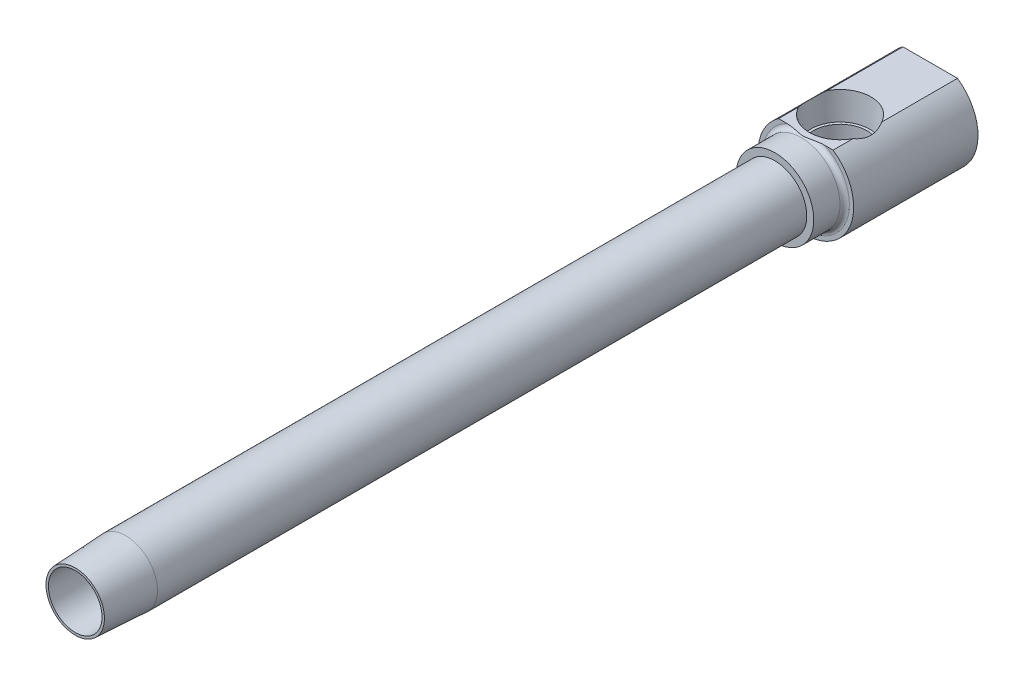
ISO-10303-21;
HEADER;
FILE_DESCRIPTION(('STEP AP214'),'2;1');
FILE_NAME('part.step','',(''),(''),'','','');
FILE_SCHEMA(('AUTOMOTIVE_DESIGN { 1 0 10303 214 1 1 1 1 }'));
ENDSEC;
DATA;
#1=APPLICATION_CONTEXT('core data for automotive mechanical design processes');
#2=APPLICATION_PROTOCOL_DEFINITION('international standard','automotive_design',2000,#1);
#3=PRODUCT_CONTEXT('',#1,'mechanical');
#4=PRODUCT('Part','Part','',(#3));
#5=PRODUCT_RELATED_PRODUCT_CATEGORY('part','',(#4));
#6=PRODUCT_DEFINITION_FORMATION('','',#4);
#7=PRODUCT_DEFINITION_CONTEXT('part definition',#1,'design');
#8=PRODUCT_DEFINITION('design','',#6,#7);
#9=PRODUCT_DEFINITION_SHAPE('','',#8);
#10=(LENGTH_UNIT() NAMED_UNIT(*) SI_UNIT(.MILLI.,.METRE.));
#11=(NAMED_UNIT(*) PLANE_ANGLE_UNIT() SI_UNIT($,.RADIAN.));
#12=(NAMED_UNIT(*) SI_UNIT($,.STERADIAN.) SOLID_ANGLE_UNIT());
#13=UNCERTAINTY_MEASURE_WITH_UNIT(LENGTH_MEASURE(1.E-05),#10,'distance_accuracy_value','');
#14=(GEOMETRIC_REPRESENTATION_CONTEXT(3) GLOBAL_UNCERTAINTY_ASSIGNED_CONTEXT((#13)) GLOBAL_UNIT_ASSIGNED_CONTEXT((#10,
#11,#12)) REPRESENTATION_CONTEXT('',''));
#15=CARTESIAN_POINT('',(0.,0.,0.));
#16=DIRECTION('',(0.,0.,1.));
#17=DIRECTION('',(1.,0.,0.));
#18=AXIS2_PLACEMENT_3D('',#15,#16,#17);
#19=CARTESIAN_POINT('',(-4.3815,0.,0.));
#20=DIRECTION('',(0.,0.,1.));
#21=DIRECTION('',(1.,0.,0.));
#22=AXIS2_PLACEMENT_3D('',#19,#20,#21);
#23=PLANE('',#22);
#24=CARTESIAN_POINT('',(0.,0.,0.));
#25=DIRECTION('',(0.,0.,-1.));
#26=DIRECTION('',(-1.,0.,0.));
#27=AXIS2_PLACEMENT_3D('',#24,#25,#26);
#28=CIRCLE('',#27,4.3815);
#29=CARTESIAN_POINT('',(-4.3815,0.,0.));
#30=VERTEX_POINT('',#29);
#31=EDGE_CURVE('E18',#30,#30,#28,.T.);
#32=ORIENTED_EDGE('',*,*,#31,.T.);
#33=EDGE_LOOP('',(#32));
#34=FACE_BOUND('',#33,.T.);
#35=CARTESIAN_POINT('',(0.,0.,0.));
#36=DIRECTION('',(0.,0.,-1.));
#37=DIRECTION('',(-1.,0.,0.));
#38=AXIS2_PLACEMENT_3D('',#35,#36,#37);
#39=CIRCLE('',#38,4.7752);
#40=CARTESIAN_POINT('',(-4.7752,0.,0.));
#41=VERTEX_POINT('',#40);
#42=EDGE_CURVE('E148',#41,#41,#39,.T.);
#43=ORIENTED_EDGE('',*,*,#42,.F.);
#44=EDGE_LOOP('',(#43));
#45=FACE_BOUND('',#44,.T.);
#46=ADVANCED_FACE('F15',(#34,#45),#23,.T.);
#47=CARTESIAN_POINT('',(0.,0.,-181.572366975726));
#48=DIRECTION('',(0.,0.,-1.));
#49=DIRECTION('',(-1.,0.,0.));
#50=AXIS2_PLACEMENT_3D('',#47,#48,#49);
#51=CYLINDRICAL_SURFACE('',#50,5.207);
#52=CARTESIAN_POINT('',(0.,0.,-8.23923482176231));
#53=DIRECTION('',(0.,0.,-1.));
#54=DIRECTION('',(-1.,0.,0.));
#55=AXIS2_PLACEMENT_3D('',#52,#53,#54);
#56=CIRCLE('',#55,5.207);
#57=CARTESIAN_POINT('',(-5.207,0.,-8.23923482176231));
#58=VERTEX_POINT('',#57);
#59=EDGE_CURVE('E150',#58,#58,#56,.T.);
#60=ORIENTED_EDGE('',*,*,#59,.T.);
#61=EDGE_LOOP('',(#60));
#62=FACE_BOUND('',#61,.T.);
#63=CARTESIAN_POINT('',(0.,0.,-114.3254));
#64=DIRECTION('',(0.,0.,-1.));
#65=DIRECTION('',(-1.,0.,0.));
#66=AXIS2_PLACEMENT_3D('',#63,#64,#65);
#67=CIRCLE('',#66,5.207);
#68=CARTESIAN_POINT('',(-5.207,0.,-114.3254));
#69=VERTEX_POINT('',#68);
#70=EDGE_CURVE('E240',#69,#69,#67,.T.);
#71=ORIENTED_EDGE('',*,*,#70,.F.);
#72=EDGE_LOOP('',(#71));
#73=FACE_BOUND('',#72,.T.);
#74=ADVANCED_FACE('F135',(#62,#73),#51,.T.);
#75=CARTESIAN_POINT('',(-4.4577,6.41348742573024,-106.3752));
#76=DIRECTION('',(0.,-1.,0.));
#77=DIRECTION('',(0.,0.,-1.));
#78=AXIS2_PLACEMENT_3D('',#75,#76,#77);
#79=PLANE('',#78);
#80=DIRECTION('',(0.,0.,-1.));
#81=VECTOR('',#80,1.);
#82=CARTESIAN_POINT('',(4.4577,6.41348742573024,-106.3752));
#83=LINE('',#82,#81);
#84=CARTESIAN_POINT('',(4.4577,6.41348742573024,-119.38));
#85=VERTEX_POINT('',#84);
#86=CARTESIAN_POINT('',(4.4577,6.41348742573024,-122.621408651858));
#87=VERTEX_POINT('',#86);
#88=EDGE_CURVE('E293',#85,#87,#83,.T.);
#89=ORIENTED_EDGE('',*,*,#88,.T.);
#90=CARTESIAN_POINT('',(0.,6.41348742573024,-124.968));
#91=DIRECTION('',(0.,-1.,0.));
#92=DIRECTION('',(0.,0.,-1.));
#93=AXIS2_PLACEMENT_3D('',#90,#91,#92);
#94=CIRCLE('',#93,5.03761652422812);
#95=CARTESIAN_POINT('',(-4.4577,6.41348742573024,-122.621408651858));
#96=VERTEX_POINT('',#95);
#97=EDGE_CURVE('E157',#87,#96,#94,.T.);
#98=ORIENTED_EDGE('',*,*,#97,.T.);
#99=DIRECTION('',(0.,0.,-1.));
#100=VECTOR('',#99,1.);
#101=CARTESIAN_POINT('',(-4.4577,6.41348742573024,-106.3752));
#102=LINE('',#101,#100);
#103=CARTESIAN_POINT('',(-4.4577,6.41348742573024,-119.38));
#104=VERTEX_POINT('',#103);
#105=EDGE_CURVE('E291',#104,#96,#102,.T.);
#106=ORIENTED_EDGE('',*,*,#105,.F.);
#107=DIRECTION('',(1.,0.,0.));
#108=VECTOR('',#107,1.);
#109=CARTESIAN_POINT('',(-7.112,6.41348742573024,-119.38));
#110=LINE('',#109,#108);
#111=CARTESIAN_POINT('',(-3.07371485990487,6.41348742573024,-119.38));
#112=VERTEX_POINT('',#111);
#113=EDGE_CURVE('E282',#104,#112,#110,.T.);
#114=ORIENTED_EDGE('',*,*,#113,.T.);
#115=CARTESIAN_POINT('',(0.,6.41348742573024,-118.922506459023));
#116=CARTESIAN_POINT('',(0.0547669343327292,6.41348742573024,-118.922502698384));
#117=CARTESIAN_POINT('',(0.109530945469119,6.41348742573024,-118.924131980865));
#118=CARTESIAN_POINT('',(0.21888843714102,6.41348742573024,-118.930434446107));
#119=CARTESIAN_POINT('',(0.273481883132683,6.41348742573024,-118.93510820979));
#120=CARTESIAN_POINT('',(0.437133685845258,6.41348742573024,-118.952954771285));
#121=CARTESIAN_POINT('',(0.545759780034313,6.41348742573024,-118.969948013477));
#122=CARTESIAN_POINT('',(0.763468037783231,6.41348742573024,-119.009460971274));
#123=CARTESIAN_POINT('',(0.872535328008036,6.41348742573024,-119.032054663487));
#124=CARTESIAN_POINT('',(1.09015205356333,6.41348742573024,-119.079005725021));
#125=CARTESIAN_POINT('',(1.19870193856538,6.41348742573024,-119.10336104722));
#126=CARTESIAN_POINT('',(1.44122492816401,6.41348742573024,-119.157231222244));
#127=CARTESIAN_POINT('',(1.57522547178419,6.41348742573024,-119.186625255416));
#128=CARTESIAN_POINT('',(1.8440760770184,6.41348742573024,-119.241759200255));
#129=CARTESIAN_POINT('',(1.97892653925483,6.41348742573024,-119.267497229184));
#130=CARTESIAN_POINT('',(2.24890278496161,6.41348742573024,-119.312646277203));
#131=CARTESIAN_POINT('',(2.38402236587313,6.41348742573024,-119.332093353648));
#132=CARTESIAN_POINT('',(2.65521795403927,6.41348742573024,-119.362201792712));
#133=CARTESIAN_POINT('',(2.79129309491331,6.41348742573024,-119.372870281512));
#134=CARTESIAN_POINT('',(2.99640645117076,6.41348742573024,-119.379807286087));
#135=CARTESIAN_POINT('',(3.06529255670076,6.41348742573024,-119.380589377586));
#136=CARTESIAN_POINT('',(3.20300193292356,6.41348742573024,-119.378500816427));
#137=CARTESIAN_POINT('',(3.27182521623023,6.41348742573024,-119.375631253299));
#138=CARTESIAN_POINT('',(3.40907712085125,6.41348742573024,-119.365580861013));
#139=CARTESIAN_POINT('',(3.47750615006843,6.41348742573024,-119.358405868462));
#140=CARTESIAN_POINT('',(3.61360674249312,6.41348742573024,-119.338913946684));
#141=CARTESIAN_POINT('',(3.68127881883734,6.41348742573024,-119.326600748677));
#142=CARTESIAN_POINT('',(3.81134745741,6.41348742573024,-119.296638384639));
#143=CARTESIAN_POINT('',(3.87382282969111,6.41348742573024,-119.279338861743));
#144=CARTESIAN_POINT('',(3.99661419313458,6.41348742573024,-119.237990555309));
#145=CARTESIAN_POINT('',(4.05692926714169,6.41348742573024,-119.213938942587));
#146=CARTESIAN_POINT('',(4.16438836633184,6.41348742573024,-119.161987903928));
#147=CARTESIAN_POINT('',(4.21210790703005,6.41348742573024,-119.135296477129));
#148=CARTESIAN_POINT('',(4.30289303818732,6.41348742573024,-119.074877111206));
#149=CARTESIAN_POINT('',(4.34597104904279,6.41348742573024,-119.041168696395));
#150=CARTESIAN_POINT('',(4.40881816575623,6.41348742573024,-118.980664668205));
#151=CARTESIAN_POINT('',(4.43105110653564,6.41348742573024,-118.956438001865));
#152=CARTESIAN_POINT('',(4.47168650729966,6.41348742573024,-118.904939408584));
#153=CARTESIAN_POINT('',(4.49009362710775,6.41348742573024,-118.877671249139));
#154=CARTESIAN_POINT('',(4.51921410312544,6.41348742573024,-118.82504266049));
#155=CARTESIAN_POINT('',(4.53069614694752,6.41348742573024,-118.800111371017));
#156=CARTESIAN_POINT('',(4.54935954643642,6.41348742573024,-118.74867800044));
#157=CARTESIAN_POINT('',(4.55654415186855,6.41348742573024,-118.722177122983));
#158=CARTESIAN_POINT('',(4.56604079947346,6.41348742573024,-118.668144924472));
#159=CARTESIAN_POINT('',(4.56832514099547,6.41348742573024,-118.640608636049));
#160=CARTESIAN_POINT('',(4.56771494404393,6.41348742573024,-118.585594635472));
#161=CARTESIAN_POINT('',(4.56482077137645,6.41348742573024,-118.558116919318));
#162=CARTESIAN_POINT('',(4.55461750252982,6.41348742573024,-118.506573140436));
#163=CARTESIAN_POINT('',(4.54772671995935,6.41348742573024,-118.482421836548));
#164=CARTESIAN_POINT('',(4.53037439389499,6.41348742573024,-118.435451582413));
#165=CARTESIAN_POINT('',(4.51991160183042,6.41348742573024,-118.412633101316));
#166=CARTESIAN_POINT('',(4.49089034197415,6.41348742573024,-118.359253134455));
#167=CARTESIAN_POINT('',(4.47078194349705,6.41348742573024,-118.329535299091));
#168=CARTESIAN_POINT('',(4.42607813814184,6.41348742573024,-118.273694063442));
#169=CARTESIAN_POINT('',(4.40147230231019,6.41348742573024,-118.2475792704));
#170=CARTESIAN_POINT('',(4.33512083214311,6.41348742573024,-118.185846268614));
#171=CARTESIAN_POINT('',(4.29121960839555,6.41348742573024,-118.152560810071));
#172=CARTESIAN_POINT('',(4.19894894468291,6.41348742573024,-118.092992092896));
#173=CARTESIAN_POINT('',(4.15057028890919,6.41348742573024,-118.066723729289));
#174=CARTESIAN_POINT('',(4.05679374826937,6.41348742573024,-118.022729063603));
#175=CARTESIAN_POINT('',(4.01168660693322,6.41348742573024,-118.004369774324));
#176=CARTESIAN_POINT('',(3.9200501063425,6.41348742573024,-117.971582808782));
#177=CARTESIAN_POINT('',(3.87351963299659,6.41348742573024,-117.957158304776));
#178=CARTESIAN_POINT('',(3.73245646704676,6.41348742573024,-117.918915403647));
#179=CARTESIAN_POINT('',(3.63654836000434,6.41348742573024,-117.9001691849));
#180=CARTESIAN_POINT('',(3.44110716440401,6.41348742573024,-117.872600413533));
#181=CARTESIAN_POINT('',(3.34154251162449,6.41348742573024,-117.864028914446));
#182=CARTESIAN_POINT('',(3.14195452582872,6.41348742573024,-117.855217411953));
#183=CARTESIAN_POINT('',(3.04193075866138,6.41348742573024,-117.854988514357));
#184=CARTESIAN_POINT('',(2.84160218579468,6.41348742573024,-117.861135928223));
#185=CARTESIAN_POINT('',(2.74129862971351,6.41348742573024,-117.86754664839));
#186=CARTESIAN_POINT('',(2.54132534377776,6.41348742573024,-117.885618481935));
#187=CARTESIAN_POINT('',(2.44165493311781,6.41348742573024,-117.897272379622));
#188=CARTESIAN_POINT('',(2.13711894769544,6.41348742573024,-117.939263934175));
#189=CARTESIAN_POINT('',(1.93319771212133,6.41348742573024,-117.97628574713));
#190=CARTESIAN_POINT('',(1.62827949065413,6.41348742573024,-118.038357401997));
#191=CARTESIAN_POINT('',(1.52655364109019,6.41348742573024,-118.060199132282));
#192=CARTESIAN_POINT('',(1.32330984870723,6.41348742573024,-118.10483124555));
#193=CARTESIAN_POINT('',(1.22179189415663,6.41348742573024,-118.127621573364));
#194=CARTESIAN_POINT('',(1.02058637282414,6.41348742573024,-118.17212134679));
#195=CARTESIAN_POINT('',(0.92090158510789,6.41348742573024,-118.19384319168));
#196=CARTESIAN_POINT('',(0.720902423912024,6.41348742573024,-118.23448684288));
#197=CARTESIAN_POINT('',(0.620587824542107,6.41348742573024,-118.253407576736));
#198=CARTESIAN_POINT('',(0.419827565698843,6.41348742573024,-118.284865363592));
#199=CARTESIAN_POINT('',(0.319392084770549,6.41348742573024,-118.297460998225));
#200=CARTESIAN_POINT('',(0.1682243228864,6.41348742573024,-118.308901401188));
#201=CARTESIAN_POINT('',(0.117779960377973,6.41348742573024,-118.311473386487));
#202=CARTESIAN_POINT('',(0.016827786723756,6.41348742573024,-118.31389611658));
#203=CARTESIAN_POINT('',(-0.0336800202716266,6.41348742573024,-118.313747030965));
#204=CARTESIAN_POINT('',(-0.167203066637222,6.41348742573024,-118.309734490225));
#205=CARTESIAN_POINT('',(-0.250151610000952,6.41348742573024,-118.303534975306));
#206=CARTESIAN_POINT('',(-0.41540653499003,6.41348742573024,-118.285308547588));
#207=CARTESIAN_POINT('',(-0.497712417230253,6.41348742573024,-118.273277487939));
#208=CARTESIAN_POINT('',(-0.662364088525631,6.41348742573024,-118.245484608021));
#209=CARTESIAN_POINT('',(-0.744704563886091,6.41348742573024,-118.229692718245));
#210=CARTESIAN_POINT('',(-0.908954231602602,6.41348742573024,-118.196225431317));
#211=CARTESIAN_POINT('',(-0.990863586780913,6.41348742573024,-118.178550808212));
#212=CARTESIAN_POINT('',(-1.15599570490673,6.41348742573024,-118.1422569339));
#213=CARTESIAN_POINT('',(-1.23921597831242,6.41348742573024,-118.123626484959));
#214=CARTESIAN_POINT('',(-1.40572088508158,6.41348742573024,-118.086671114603));
#215=CARTESIAN_POINT('',(-1.48900551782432,6.41348742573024,-118.06834619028));
#216=CARTESIAN_POINT('',(-1.73866654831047,6.41348742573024,-118.015071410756));
#217=CARTESIAN_POINT('',(-1.90540243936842,6.41348742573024,-117.98168897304));
#218=CARTESIAN_POINT('',(-2.16681921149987,6.41348742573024,-117.936734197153));
#219=CARTESIAN_POINT('',(-2.26095047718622,6.41348742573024,-117.922025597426));
#220=CARTESIAN_POINT('',(-2.44971550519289,6.41348742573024,-117.896348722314));
#221=CARTESIAN_POINT('',(-2.54434917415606,6.41348742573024,-117.885379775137));
#222=CARTESIAN_POINT('',(-2.73368335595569,6.41348742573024,-117.868201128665));
#223=CARTESIAN_POINT('',(-2.82838206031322,6.41348742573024,-117.861972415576));
#224=CARTESIAN_POINT('',(-3.01793602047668,6.41348742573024,-117.855372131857));
#225=CARTESIAN_POINT('',(-3.11279113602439,6.41348742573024,-117.854996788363));
#226=CARTESIAN_POINT('',(-3.31218734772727,6.41348742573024,-117.861898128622));
#227=CARTESIAN_POINT('',(-3.41671052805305,6.41348742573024,-117.86997414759));
#228=CARTESIAN_POINT('',(-3.57234667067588,6.41348742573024,-117.890810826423));
#229=CARTESIAN_POINT('',(-3.62404703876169,6.41348742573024,-117.899213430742));
#230=CARTESIAN_POINT('',(-3.72677708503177,6.41348742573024,-117.919392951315));
#231=CARTESIAN_POINT('',(-3.77780699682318,6.41348742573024,-117.931168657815));
#232=CARTESIAN_POINT('',(-3.89634421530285,6.41348742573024,-117.963403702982));
#233=CARTESIAN_POINT('',(-3.96343170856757,6.41348742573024,-117.985458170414));
#234=CARTESIAN_POINT('',(-4.09405850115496,6.41348742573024,-118.038413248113));
#235=CARTESIAN_POINT('',(-4.1576046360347,6.41348742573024,-118.069296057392));
#236=CARTESIAN_POINT('',(-4.25441976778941,6.41348742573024,-118.127888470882));
#237=CARTESIAN_POINT('',(-4.28979385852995,6.41348742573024,-118.1520976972));
#238=CARTESIAN_POINT('',(-4.35685699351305,6.41348742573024,-118.205223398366));
#239=CARTESIAN_POINT('',(-4.38855051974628,6.41348742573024,-118.23413404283));
#240=CARTESIAN_POINT('',(-4.43937896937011,6.41348742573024,-118.289413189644));
#241=CARTESIAN_POINT('',(-4.45969325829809,6.41348742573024,-118.31468864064));
#242=CARTESIAN_POINT('',(-4.49606293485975,6.41348742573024,-118.36815327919));
#243=CARTESIAN_POINT('',(-4.51212457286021,6.41348742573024,-118.396338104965));
#244=CARTESIAN_POINT('',(-4.5362672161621,6.41348742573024,-118.449729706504));
#245=CARTESIAN_POINT('',(-4.5452774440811,6.41348742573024,-118.474513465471));
#246=CARTESIAN_POINT('',(-4.55902605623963,6.41348742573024,-118.525243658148));
#247=CARTESIAN_POINT('',(-4.56376753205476,6.41348742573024,-118.551189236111));
#248=CARTESIAN_POINT('',(-4.56859445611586,6.41348742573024,-118.603605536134));
#249=CARTESIAN_POINT('',(-4.5686642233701,6.41348742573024,-118.630077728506));
#250=CARTESIAN_POINT('',(-4.56410153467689,6.41348742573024,-118.682612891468));
#251=CARTESIAN_POINT('',(-4.55946793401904,6.41348742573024,-118.708675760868));
#252=CARTESIAN_POINT('',(-4.54620785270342,6.41348742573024,-118.758450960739));
#253=CARTESIAN_POINT('',(-4.53777611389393,6.41348742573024,-118.78221625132));
#254=CARTESIAN_POINT('',(-4.51754524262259,6.41348742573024,-118.828251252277));
#255=CARTESIAN_POINT('',(-4.50574488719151,6.41348742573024,-118.850520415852));
#256=CARTESIAN_POINT('',(-4.47265204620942,6.41348742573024,-118.904236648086));
#257=CARTESIAN_POINT('',(-4.44958451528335,6.41348742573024,-118.934590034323));
#258=CARTESIAN_POINT('',(-4.39893449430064,6.41348742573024,-118.991262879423));
#259=CARTESIAN_POINT('',(-4.37134039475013,6.41348742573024,-119.017571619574));
#260=CARTESIAN_POINT('',(-4.29637766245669,6.41348742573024,-119.080336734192));
#261=CARTESIAN_POINT('',(-4.24670632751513,6.41348742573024,-119.114023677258));
#262=CARTESIAN_POINT('',(-4.14294758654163,6.41348742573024,-119.173603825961));
#263=CARTESIAN_POINT('',(-4.08885088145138,6.41348742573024,-119.1994800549));
#264=CARTESIAN_POINT('',(-3.98330416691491,6.41348742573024,-119.24266584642));
#265=CARTESIAN_POINT('',(-3.93208515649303,6.41348742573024,-119.260552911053));
#266=CARTESIAN_POINT('',(-3.82828626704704,6.41348742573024,-119.291892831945));
#267=CARTESIAN_POINT('',(-3.77570527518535,6.41348742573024,-119.305341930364));
#268=CARTESIAN_POINT('',(-3.66966451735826,6.41348742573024,-119.328467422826));
#269=CARTESIAN_POINT('',(-3.61620370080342,6.41348742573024,-119.338138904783));
#270=CARTESIAN_POINT('',(-3.5088236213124,6.41348742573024,-119.354213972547));
#271=CARTESIAN_POINT('',(-3.45490452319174,6.41348742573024,-119.360618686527));
#272=CARTESIAN_POINT('',(-3.32893010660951,6.41348742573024,-119.372254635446));
#273=CARTESIAN_POINT('',(-3.25677506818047,6.41348742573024,-119.376396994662));
#274=CARTESIAN_POINT('',(-3.11233636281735,6.41348742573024,-119.380499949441));
#275=CARTESIAN_POINT('',(-3.04005265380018,6.41348742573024,-119.380458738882));
#276=CARTESIAN_POINT('',(-2.82311145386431,6.41348742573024,-119.375065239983));
#277=CARTESIAN_POINT('',(-2.67858508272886,6.41348742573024,-119.364427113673));
#278=CARTESIAN_POINT('',(-2.38941343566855,6.41348742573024,-119.333026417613));
#279=CARTESIAN_POINT('',(-2.24477928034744,6.41348742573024,-119.312171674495));
#280=CARTESIAN_POINT('',(-1.95690250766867,6.41348742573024,-119.263578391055));
#281=CARTESIAN_POINT('',(-1.81365833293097,6.41348742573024,-119.235848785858));
#282=CARTESIAN_POINT('',(-1.53108031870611,6.41348742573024,-119.177154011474));
#283=CARTESIAN_POINT('',(-1.39172865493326,6.41348742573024,-119.14627129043));
#284=CARTESIAN_POINT('',(-1.18259583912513,6.41348742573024,-119.099745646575));
#285=CARTESIAN_POINT('',(-1.11279428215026,6.41348742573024,-119.084187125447));
#286=CARTESIAN_POINT('',(-0.973069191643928,6.41348742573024,-119.053631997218));
#287=CARTESIAN_POINT('',(-0.903145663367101,6.41348742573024,-119.038635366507));
#288=CARTESIAN_POINT('',(-0.764296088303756,6.41348742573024,-119.010259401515));
#289=CARTESIAN_POINT('',(-0.695375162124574,6.41348742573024,-118.996855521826));
#290=CARTESIAN_POINT('',(-0.557105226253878,6.41348742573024,-118.972372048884));
#291=CARTESIAN_POINT('',(-0.487756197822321,6.41348742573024,-118.961292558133));
#292=CARTESIAN_POINT('',(-0.348841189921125,6.41348742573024,-118.942764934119));
#293=CARTESIAN_POINT('',(-0.279277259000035,6.41348742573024,-118.935302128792));
#294=CARTESIAN_POINT('',(-0.139807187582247,6.41348742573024,-118.925176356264));
#295=CARTESIAN_POINT('',(-0.0699012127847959,6.41348742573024,-118.922511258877));
#296=CARTESIAN_POINT('',(0.,6.41348742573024,-118.922506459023));
#297=B_SPLINE_CURVE_WITH_KNOTS('',3,(#115,#116,#117,#118,#119,#120,#121,#122,#123,#124,#125,
#126,#127,#128,#129,#130,#131,#132,#133,#134,#135,#136,#137,#138,#139,#140,#141,#142,#143,#144,
#145,#146,#147,#148,#149,#150,#151,#152,#153,#154,#155,#156,#157,#158,#159,#160,#161,#162,#163,
#164,#165,#166,#167,#168,#169,#170,#171,#172,#173,#174,#175,#176,#177,#178,#179,#180,#181,#182,
#183,#184,#185,#186,#187,#188,#189,#190,#191,#192,#193,#194,#195,#196,#197,#198,#199,#200,#201,
#202,#203,#204,#205,#206,#207,#208,#209,#210,#211,#212,#213,#214,#215,#216,#217,#218,#219,#220,
#221,#222,#223,#224,#225,#226,#227,#228,#229,#230,#231,#232,#233,#234,#235,#236,#237,#238,#239,
#240,#241,#242,#243,#244,#245,#246,#247,#248,#249,#250,#251,#252,#253,#254,#255,#256,#257,#258,
#259,#260,#261,#262,#263,#264,#265,#266,#267,#268,#269,#270,#271,#272,#273,#274,#275,#276,#277,
#278,#279,#280,#281,#282,#283,#284,#285,#286,#287,#288,#289,#290,#291,#292,#293,#294,#295,#296),
.UNSPECIFIED.,.T.,.F.,(4,2,2,2,2,2,2,2,2,2,2,2,2,2,2,2,2,2,2,2,2,2,2,2,2,2,2,2,2,2,2,2,2,2,2,2,
2,2,2,2,2,2,2,2,2,2,2,2,2,2,2,2,2,2,2,2,2,2,2,2,2,2,2,2,2,2,2,2,2,2,2,2,2,2,2,2,2,2,2,2,2,2,2,2,
2,2,2,2,2,2,4),(0.,0.164273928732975,0.328579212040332,0.65809673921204,0.992223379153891,
1.32596779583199,1.73751584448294,2.14927506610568,2.55863060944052,2.96765352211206,
3.17424892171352,3.3807826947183,3.5870371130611,3.79314201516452,3.98733137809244,
4.18160222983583,4.34518473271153,4.50831802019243,4.6066826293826,4.70492671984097,
4.78693922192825,4.86888962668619,4.95130208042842,5.03370871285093,5.10874003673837,
5.18379761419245,5.29083718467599,5.39812818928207,5.56248306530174,5.72718409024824,
5.87307196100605,6.01907710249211,6.31139884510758,6.61079267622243,6.91058505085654,
7.21193886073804,7.5128792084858,8.13412004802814,8.44626765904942,8.75839714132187,
9.06445930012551,9.37063833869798,9.67392675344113,9.82538795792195,9.97683972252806,
10.2260774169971,10.4754926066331,10.7269732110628,10.9783508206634,11.2341897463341,
11.490026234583,11.9999950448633,12.2857569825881,12.5714675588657,12.8560259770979,
13.1404009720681,13.4543312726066,13.6113768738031,13.7683662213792,13.9797728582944,
14.1907561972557,14.3190471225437,14.4471801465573,14.5441362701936,14.6409490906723,
14.719730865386,14.7984555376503,14.8774444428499,14.9564525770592,15.0318037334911,
15.1071822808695,15.2209045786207,15.3349232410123,15.5139662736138,15.6933957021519,
15.8559161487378,16.0185738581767,16.1814423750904,16.344254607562,16.5609200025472,
16.7776789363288,17.2118589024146,17.6500302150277,18.0876350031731,18.5158248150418,
18.7303690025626,18.9449041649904,19.1555191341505,19.3661433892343,19.5759058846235,
19.7855752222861),.UNSPECIFIED.);
#298=CARTESIAN_POINT('',(3.07371485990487,6.41348742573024,-119.38));
#299=VERTEX_POINT('',#298);
#300=EDGE_CURVE('E232',#112,#299,#297,.T.);
#301=ORIENTED_EDGE('',*,*,#300,.T.);
#302=EDGE_CURVE('E297',#299,#85,#110,.T.);
#303=ORIENTED_EDGE('',*,*,#302,.T.);
#304=EDGE_LOOP('',(#89,#98,#106,#114,#301,#303));
#305=FACE_BOUND('',#304,.T.);
#306=ADVANCED_FACE('F141',(#305),#79,.F.);
#307=CARTESIAN_POINT('',(0.,0.,-181.572366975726));
#308=DIRECTION('',(0.,0.,-1.));
#309=DIRECTION('',(-1.,0.,0.));
#310=AXIS2_PLACEMENT_3D('',#307,#308,#309);
#311=CYLINDRICAL_SURFACE('',#310,4.3815);
#312=ORIENTED_EDGE('',*,*,#31,.F.);
#313=EDGE_LOOP('',(#312));
#314=FACE_BOUND('',#313,.T.);
#315=CARTESIAN_POINT('',(0.,0.,-114.3254));
#316=DIRECTION('',(0.,0.,-1.));
#317=DIRECTION('',(-1.,0.,0.));
#318=AXIS2_PLACEMENT_3D('',#315,#316,#317);
#319=CIRCLE('',#318,4.3815);
#320=CARTESIAN_POINT('',(-3.16538744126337,-3.02949906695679,-114.3254));
#321=VERTEX_POINT('',#320);
#322=CARTESIAN_POINT('',(3.16538744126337,-3.02949906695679,-114.3254));
#323=VERTEX_POINT('',#322);
#324=EDGE_CURVE('E235',#321,#323,#319,.T.);
#325=ORIENTED_EDGE('',*,*,#324,.T.);
#326=CARTESIAN_POINT('',(3.16547479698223,-3.02940779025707,-114.3256));
#327=CARTESIAN_POINT('',(3.14342446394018,-3.05243943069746,-114.275077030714));
#328=CARTESIAN_POINT('',(3.11972293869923,-3.07670954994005,-114.225848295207));
#329=CARTESIAN_POINT('',(3.06888207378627,-3.12742914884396,-114.130394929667));
#330=CARTESIAN_POINT('',(3.04174325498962,-3.15387829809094,-114.084169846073));
#331=CARTESIAN_POINT('',(2.9555915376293,-3.23545829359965,-113.951577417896));
#332=CARTESIAN_POINT('',(2.89136505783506,-3.29334010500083,-113.87016786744));
#333=CARTESIAN_POINT('',(2.75011359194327,-3.41217163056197,-113.722271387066));
#334=CARTESIAN_POINT('',(2.67308610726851,-3.47312194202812,-113.65578737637));
#335=CARTESIAN_POINT('',(2.50819184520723,-3.59402230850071,-113.53634210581));
#336=CARTESIAN_POINT('',(2.42029620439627,-3.653969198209,-113.483418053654));
#337=CARTESIAN_POINT('',(2.25775713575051,-3.75593106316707,-113.400236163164));
#338=CARTESIAN_POINT('',(2.18486784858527,-3.79884421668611,-113.367575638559));
#339=CARTESIAN_POINT('',(2.03488862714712,-3.88124850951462,-113.307990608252));
#340=CARTESIAN_POINT('',(1.95779677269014,-3.92073806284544,-113.281068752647));
#341=CARTESIAN_POINT('',(1.80004579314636,-3.99562399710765,-113.232117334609));
#342=CARTESIAN_POINT('',(1.71938265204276,-4.03101559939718,-113.210093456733));
#343=CARTESIAN_POINT('',(1.55515017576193,-4.09718246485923,-113.170304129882));
#344=CARTESIAN_POINT('',(1.4715796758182,-4.12795585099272,-113.152540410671));
#345=CARTESIAN_POINT('',(1.21289030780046,-4.21425858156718,-113.104005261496));
#346=CARTESIAN_POINT('',(1.03389313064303,-4.26180132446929,-113.079192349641));
#347=CARTESIAN_POINT('',(0.67022760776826,-4.33390350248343,-113.042389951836));
#348=CARTESIAN_POINT('',(0.485562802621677,-4.35847699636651,-113.030392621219));
#349=CARTESIAN_POINT('',(0.191999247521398,-4.37863265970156,-113.020580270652));
#350=CARTESIAN_POINT('',(0.0836976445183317,-4.38203983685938,-113.01893316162));
#351=CARTESIAN_POINT('',(-0.132842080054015,-4.38082235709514,-113.019520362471));
#352=CARTESIAN_POINT('',(-0.241080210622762,-4.37619962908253,-113.021753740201));
#353=CARTESIAN_POINT('',(-0.456961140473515,-4.35895390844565,-113.030180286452));
#354=CARTESIAN_POINT('',(-0.564602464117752,-4.34631610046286,-113.036380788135));
#355=CARTESIAN_POINT('',(-0.778298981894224,-4.31317491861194,-113.05296127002));
#356=CARTESIAN_POINT('',(-0.884354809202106,-4.29267477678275,-113.063339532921));
#357=CARTESIAN_POINT('',(-1.09632494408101,-4.24354696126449,-113.088913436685));
#358=CARTESIAN_POINT('',(-1.20219105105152,-4.21476010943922,-113.104204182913));
#359=CARTESIAN_POINT('',(-1.41060084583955,-4.14965783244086,-113.140134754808));
#360=CARTESIAN_POINT('',(-1.513146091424,-4.11334599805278,-113.160772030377));
#361=CARTESIAN_POINT('',(-1.71390456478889,-4.03381995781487,-113.208258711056));
#362=CARTESIAN_POINT('',(-1.81212318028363,-3.99061466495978,-113.235100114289));
#363=CARTESIAN_POINT('',(-2.00320334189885,-3.8982035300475,-113.296192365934));
#364=CARTESIAN_POINT('',(-2.09606839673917,-3.84900168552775,-113.330438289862));
#365=CARTESIAN_POINT('',(-2.29534319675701,-3.73428068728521,-113.416661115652));
#366=CARTESIAN_POINT('',(-2.40014619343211,-3.66757137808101,-113.470889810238));
#367=CARTESIAN_POINT('',(-2.54748315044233,-3.56531535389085,-113.564688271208));
#368=CARTESIAN_POINT('',(-2.59488453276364,-3.53092006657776,-113.59796870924));
#369=CARTESIAN_POINT('',(-2.68608105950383,-3.46204578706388,-113.669051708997));
#370=CARTESIAN_POINT('',(-2.72987823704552,-3.42756685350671,-113.706851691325));
#371=CARTESIAN_POINT('',(-2.81247040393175,-3.36010888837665,-113.786220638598));
#372=CARTESIAN_POINT('',(-2.85136068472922,-3.3271137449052,-113.827676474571));
#373=CARTESIAN_POINT('',(-2.92505072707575,-3.26251751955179,-113.915085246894));
#374=CARTESIAN_POINT('',(-2.95985031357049,-3.23091649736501,-113.961038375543));
#375=CARTESIAN_POINT('',(-3.025662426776,-3.16938090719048,-114.057865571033));
#376=CARTESIAN_POINT('',(-3.05661307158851,-3.13947696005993,-114.108801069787));
#377=CARTESIAN_POINT('',(-3.11423662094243,-3.0823220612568,-114.214485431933));
#378=CARTESIAN_POINT('',(-3.1409073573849,-3.05507245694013,-114.269236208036));
#379=CARTESIAN_POINT('',(-3.16547479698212,-3.02940779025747,-114.3256));
#380=B_SPLINE_CURVE_WITH_KNOTS('',3,(#326,#327,#328,#329,#330,#331,#332,#333,#334,#335,#336,
#337,#338,#339,#340,#341,#342,#343,#344,#345,#346,#347,#348,#349,#350,#351,#352,#353,#354,#355,
#356,#357,#358,#359,#360,#361,#362,#363,#364,#365,#366,#367,#368,#369,#370,#371,#372,#373,#374,
#375,#376,#377,#378,#379),.UNSPECIFIED.,.F.,.F.,(4,2,2,2,2,2,2,2,2,2,2,2,2,2,2,2,2,2,2,2,2,2,2,
2,2,2,4),(0.,0.179155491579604,0.358283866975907,0.71261180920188,1.06700899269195,
1.42236845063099,1.69403668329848,1.96583010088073,2.23793733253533,2.51015486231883,
3.06856026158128,3.62662365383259,3.95140246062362,4.27610326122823,4.60140600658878,
4.92657516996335,5.25846293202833,5.59019268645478,5.92149695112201,6.25258155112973,
6.65760632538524,6.85948934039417,7.06125768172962,7.25815107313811,7.45505288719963,
7.65479552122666,7.85463902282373),.UNSPECIFIED.);
#381=EDGE_CURVE('E203',#323,#321,#380,.T.);
#382=ORIENTED_EDGE('',*,*,#381,.T.);
#383=EDGE_LOOP('',(#325,#382));
#384=FACE_BOUND('',#383,.T.);
#385=ADVANCED_FACE('F234',(#314,#384),#311,.F.);
#386=CARTESIAN_POINT('',(-4.3815,0.,-114.3254));
#387=DIRECTION('',(0.,0.,1.));
#388=DIRECTION('',(1.,0.,0.));
#389=AXIS2_PLACEMENT_3D('',#386,#387,#388);
#390=PLANE('',#389);
#391=ORIENTED_EDGE('',*,*,#324,.F.);
#392=CARTESIAN_POINT('',(0.,-0.364745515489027,-114.3254));
#393=DIRECTION('',(0.,0.,1.));
#394=DIRECTION('',(0.,1.,0.));
#395=AXIS2_PLACEMENT_3D('',#392,#393,#394);
#396=ELLIPSE('',#395,4.20023414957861,4.09504169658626);
#397=EDGE_CURVE('E195',#321,#323,#396,.F.);
#398=ORIENTED_EDGE('',*,*,#397,.T.);
#399=EDGE_LOOP('',(#391,#398));
#400=FACE_BOUND('',#399,.T.);
#401=ADVANCED_FACE('F237',(#400),#390,.T.);
#402=CARTESIAN_POINT('',(-5.207,0.,-114.3254));
#403=DIRECTION('',(0.,0.,1.));
#404=DIRECTION('',(1.,0.,0.));
#405=AXIS2_PLACEMENT_3D('',#402,#403,#404);
#406=PLANE('',#405);
#407=ORIENTED_EDGE('',*,*,#70,.T.);
#408=EDGE_LOOP('',(#407));
#409=FACE_BOUND('',#408,.T.);
#410=CARTESIAN_POINT('',(0.,0.,-114.3254));
#411=DIRECTION('',(0.,0.,-1.));
#412=DIRECTION('',(-1.,0.,0.));
#413=AXIS2_PLACEMENT_3D('',#410,#411,#412);
#414=CIRCLE('',#413,6.35);
#415=CARTESIAN_POINT('',(-6.35,0.,-114.3254));
#416=VERTEX_POINT('',#415);
#417=EDGE_CURVE('E273',#416,#416,#414,.T.);
#418=ORIENTED_EDGE('',*,*,#417,.F.);
#419=EDGE_LOOP('',(#418));
#420=FACE_BOUND('',#419,.T.);
#421=ADVANCED_FACE('F382',(#409,#420),#406,.T.);
#422=CARTESIAN_POINT('',(-7.8105,0.,-139.7));
#423=DIRECTION('',(0.,0.,-1.));
#424=DIRECTION('',(-1.,0.,0.));
#425=AXIS2_PLACEMENT_3D('',#422,#423,#424);
#426=PLANE('',#425);
#427=DIRECTION('',(1.,0.,0.));
#428=VECTOR('',#427,1.);
#429=CARTESIAN_POINT('',(-2.29502505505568,3.9751,-139.7));
#430=LINE('',#429,#428);
#431=CARTESIAN_POINT('',(-2.29502505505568,3.9751,-139.7));
#432=VERTEX_POINT('',#431);
#433=CARTESIAN_POINT('',(2.29502505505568,3.9751,-139.7));
#434=VERTEX_POINT('',#433);
#435=EDGE_CURVE('E236',#432,#434,#430,.T.);
#436=ORIENTED_EDGE('',*,*,#435,.F.);
#437=DIRECTION('',(0.5,0.866025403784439,0.));
#438=VECTOR('',#437,1.);
#439=CARTESIAN_POINT('',(-4.59005011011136,0.,-139.7));
#440=LINE('',#439,#438);
#441=CARTESIAN_POINT('',(-4.59005011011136,0.,-139.7));
#442=VERTEX_POINT('',#441);
#443=EDGE_CURVE('E323',#442,#432,#440,.T.);
#444=ORIENTED_EDGE('',*,*,#443,.F.);
#445=DIRECTION('',(-0.5,0.866025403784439,0.));
#446=VECTOR('',#445,1.);
#447=CARTESIAN_POINT('',(-2.29502505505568,-3.9751,-139.7));
#448=LINE('',#447,#446);
#449=CARTESIAN_POINT('',(-2.29502505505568,-3.9751,-139.7));
#450=VERTEX_POINT('',#449);
#451=EDGE_CURVE('E327',#450,#442,#448,.T.);
#452=ORIENTED_EDGE('',*,*,#451,.F.);
#453=DIRECTION('',(-1.,0.,0.));
#454=VECTOR('',#453,1.);
#455=CARTESIAN_POINT('',(2.29502505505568,-3.9751,-139.7));
#456=LINE('',#455,#454);
#457=CARTESIAN_POINT('',(2.29502505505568,-3.9751,-139.7));
#458=VERTEX_POINT('',#457);
#459=EDGE_CURVE('E330',#458,#450,#456,.T.);
#460=ORIENTED_EDGE('',*,*,#459,.F.);
#461=DIRECTION('',(-0.5,-0.866025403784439,0.));
#462=VECTOR('',#461,1.);
#463=CARTESIAN_POINT('',(4.59005011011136,0.,-139.7));
#464=LINE('',#463,#462);
#465=CARTESIAN_POINT('',(4.59005011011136,0.,-139.7));
#466=VERTEX_POINT('',#465);
#467=EDGE_CURVE('E333',#466,#458,#464,.T.);
#468=ORIENTED_EDGE('',*,*,#467,.F.);
#469=DIRECTION('',(0.5,-0.866025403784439,0.));
#470=VECTOR('',#469,1.);
#471=CARTESIAN_POINT('',(2.29502505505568,3.9751,-139.7));
#472=LINE('',#471,#470);
#473=EDGE_CURVE('E336',#434,#466,#472,.T.);
#474=ORIENTED_EDGE('',*,*,#473,.F.);
#475=EDGE_LOOP('',(#436,#444,#452,#460,#468,#474));
#476=FACE_BOUND('',#475,.T.);
#477=DIRECTION('',(-1.,0.,0.));
#478=VECTOR('',#477,1.);
#479=CARTESIAN_POINT('',(-4.4577,6.41348742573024,-139.7));
#480=LINE('',#479,#478);
#481=CARTESIAN_POINT('',(4.4577,6.41348742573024,-139.7));
#482=VERTEX_POINT('',#481);
#483=CARTESIAN_POINT('',(-4.4577,6.41348742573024,-139.7));
#484=VERTEX_POINT('',#483);
#485=EDGE_CURVE('E306',#482,#484,#480,.T.);
#486=ORIENTED_EDGE('',*,*,#485,.F.);
#487=CARTESIAN_POINT('',(0.,0.,-139.7));
#488=DIRECTION('',(0.,0.,-1.));
#489=DIRECTION('',(-1.,0.,0.));
#490=AXIS2_PLACEMENT_3D('',#487,#488,#489);
#491=CIRCLE('',#490,7.8105);
#492=EDGE_CURVE('E238',#482,#484,#491,.T.);
#493=ORIENTED_EDGE('',*,*,#492,.T.);
#494=EDGE_LOOP('',(#486,#493));
#495=FACE_BOUND('',#494,.T.);
#496=ADVANCED_FACE('F379',(#476,#495),#426,.T.);
#497=CARTESIAN_POINT('',(0.,0.,-181.572366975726));
#498=DIRECTION('',(0.,0.,-1.));
#499=DIRECTION('',(-1.,0.,0.));
#500=AXIS2_PLACEMENT_3D('',#497,#498,#499);
#501=CYLINDRICAL_SURFACE('',#500,7.8105);
#502=CARTESIAN_POINT('',(3.4919694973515,6.98641963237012,-121.295441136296));
#503=CARTESIAN_POINT('',(3.58906870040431,6.9378960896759,-121.391298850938));
#504=CARTESIAN_POINT('',(3.68214837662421,6.88883405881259,-121.49094030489));
#505=CARTESIAN_POINT('',(3.86002319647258,6.79075982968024,-121.697470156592));
#506=CARTESIAN_POINT('',(3.94481473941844,6.74174766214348,-121.804361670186));
#507=CARTESIAN_POINT('',(4.10630083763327,6.64463270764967,-122.025696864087));
#508=CARTESIAN_POINT('',(4.18293982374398,6.59653779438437,-122.140184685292));
#509=CARTESIAN_POINT('',(4.32709776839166,6.50288590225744,-122.375666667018));
#510=CARTESIAN_POINT('',(4.39461854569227,6.4573284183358,-122.49665952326));
#511=CARTESIAN_POINT('',(4.56617688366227,6.3380970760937,-122.835931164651));
#512=CARTESIAN_POINT('',(4.66075954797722,6.26825649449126,-123.060584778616));
#513=CARTESIAN_POINT('',(4.77884662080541,6.17810554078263,-123.408872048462));
#514=CARTESIAN_POINT('',(4.81422585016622,6.15050630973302,-123.52675439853));
#515=CARTESIAN_POINT('',(4.87674528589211,6.10105356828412,-123.765843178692));
#516=CARTESIAN_POINT('',(4.90388968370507,6.07919713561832,-123.88704788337));
#517=CARTESIAN_POINT('',(4.94976694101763,6.04190398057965,-124.133123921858));
#518=CARTESIAN_POINT('',(4.96842532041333,6.02652418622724,-124.258017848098));
#519=CARTESIAN_POINT('',(4.99667728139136,6.00312132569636,-124.509520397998));
#520=CARTESIAN_POINT('',(5.00627099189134,5.99509815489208,-124.636128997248));
#521=CARTESIAN_POINT('',(5.01621670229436,5.98677905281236,-124.889999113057));
#522=CARTESIAN_POINT('',(5.01656623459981,5.98648518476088,-125.017260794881));
#523=CARTESIAN_POINT('',(5.00801128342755,5.99364363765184,-125.271242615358));
#524=CARTESIAN_POINT('',(4.99910747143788,6.00109539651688,-125.397962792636));
#525=CARTESIAN_POINT('',(4.97354185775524,6.02229474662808,-125.637311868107));
#526=CARTESIAN_POINT('',(4.95773418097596,6.03534698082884,-125.750095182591));
#527=CARTESIAN_POINT('',(4.91896243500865,6.0669877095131,-125.973649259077));
#528=CARTESIAN_POINT('',(4.89599540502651,6.08557849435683,-126.084419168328));
#529=CARTESIAN_POINT('',(4.8167929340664,6.14874010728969,-126.412550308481));
#530=CARTESIAN_POINT('',(4.75021164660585,6.20073954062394,-126.626137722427));
#531=CARTESIAN_POINT('',(4.63945981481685,6.28338047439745,-126.915334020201));
#532=CARTESIAN_POINT('',(4.60576203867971,6.30815266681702,-126.996941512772));
#533=CARTESIAN_POINT('',(4.53447848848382,6.35958762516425,-127.157818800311));
#534=CARTESIAN_POINT('',(4.49689343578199,6.38625004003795,-127.237089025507));
#535=CARTESIAN_POINT('',(4.32205340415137,6.50775479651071,-127.582823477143));
#536=CARTESIAN_POINT('',(4.16440692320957,6.61093131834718,-127.836395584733));
#537=CARTESIAN_POINT('',(3.80845756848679,6.82220207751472,-128.311369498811));
#538=CARTESIAN_POINT('',(3.61008660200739,6.93030431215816,-128.532716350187));
#539=CARTESIAN_POINT('',(3.29682765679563,7.08140586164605,-128.825508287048));
#540=CARTESIAN_POINT('',(3.19689867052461,7.12716323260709,-128.911836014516));
#541=CARTESIAN_POINT('',(2.99025804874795,7.21629286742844,-129.076495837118));
#542=CARTESIAN_POINT('',(2.88356945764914,7.25967238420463,-129.154852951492));
#543=CARTESIAN_POINT('',(2.77344990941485,7.30149887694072,-129.229155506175));
#544=B_SPLINE_CURVE_WITH_KNOTS('',3,(#502,#503,#504,#505,#506,#507,#508,#509,#510,#511,#512,
#513,#514,#515,#516,#517,#518,#519,#520,#521,#522,#523,#524,#525,#526,#527,#528,#529,#530,#531,
#532,#533,#534,#535,#536,#537,#538,#539,#540,#541,#542,#543),.UNSPECIFIED.,.F.,.F.,(4,2,2,2,2,2,
2,2,2,2,2,2,2,2,2,2,2,2,2,2,4),(0.,0.434323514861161,0.868834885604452,1.30614015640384,
1.74335807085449,2.50066107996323,2.87871388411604,3.25657393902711,3.63768926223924,
4.01879916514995,4.40001079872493,4.78119477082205,5.12468887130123,5.46832521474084,
6.15438371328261,6.42940501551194,6.70437537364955,7.64709414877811,8.5914022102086,
9.01031754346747,9.42787448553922),.UNSPECIFIED.);
#545=CARTESIAN_POINT('',(4.4577,6.41348742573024,-127.314591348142));
#546=VERTEX_POINT('',#545);
#547=EDGE_CURVE('E30',#87,#546,#544,.T.);
#548=ORIENTED_EDGE('',*,*,#547,.F.);
#549=ORIENTED_EDGE('',*,*,#88,.F.);
#550=CARTESIAN_POINT('',(0.,0.,-119.38));
#551=DIRECTION('',(0.,0.,-1.));
#552=DIRECTION('',(-1.,0.,0.));
#553=AXIS2_PLACEMENT_3D('',#550,#551,#552);
#554=CIRCLE('',#553,7.8105);
#555=EDGE_CURVE('E242',#85,#104,#554,.T.);
#556=ORIENTED_EDGE('',*,*,#555,.T.);
#557=ORIENTED_EDGE('',*,*,#105,.T.);
#558=CARTESIAN_POINT('',(-3.4919694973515,6.98641963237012,-128.640558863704));
#559=CARTESIAN_POINT('',(-3.58906870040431,6.9378960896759,-128.544701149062));
#560=CARTESIAN_POINT('',(-3.68214837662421,6.88883405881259,-128.44505969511));
#561=CARTESIAN_POINT('',(-3.86002319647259,6.79075982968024,-128.238529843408));
#562=CARTESIAN_POINT('',(-3.94481473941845,6.74174766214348,-128.131638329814));
#563=CARTESIAN_POINT('',(-4.10630083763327,6.64463270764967,-127.910303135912));
#564=CARTESIAN_POINT('',(-4.18293982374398,6.59653779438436,-127.795815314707));
#565=CARTESIAN_POINT('',(-4.32709776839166,6.50288590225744,-127.560333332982));
#566=CARTESIAN_POINT('',(-4.39461854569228,6.4573284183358,-127.43934047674));
#567=CARTESIAN_POINT('',(-4.56617688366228,6.3380970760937,-127.100068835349));
#568=CARTESIAN_POINT('',(-4.66075954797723,6.26825649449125,-126.875415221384));
#569=CARTESIAN_POINT('',(-4.77884662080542,6.17810554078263,-126.527127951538));
#570=CARTESIAN_POINT('',(-4.81422585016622,6.15050630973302,-126.40924560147));
#571=CARTESIAN_POINT('',(-4.87674528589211,6.10105356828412,-126.170156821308));
#572=CARTESIAN_POINT('',(-4.90388968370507,6.07919713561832,-126.04895211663));
#573=CARTESIAN_POINT('',(-4.94976694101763,6.04190398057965,-125.802876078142));
#574=CARTESIAN_POINT('',(-4.96842532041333,6.02652418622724,-125.677982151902));
#575=CARTESIAN_POINT('',(-4.99667728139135,6.00312132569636,-125.426479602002));
#576=CARTESIAN_POINT('',(-5.00627099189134,5.99509815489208,-125.299871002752));
#577=CARTESIAN_POINT('',(-5.01621670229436,5.98677905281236,-125.046000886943));
#578=CARTESIAN_POINT('',(-5.01656623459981,5.98648518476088,-124.918739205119));
#579=CARTESIAN_POINT('',(-5.00801128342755,5.99364363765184,-124.664757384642));
#580=CARTESIAN_POINT('',(-4.99910747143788,6.00109539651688,-124.538037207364));
#581=CARTESIAN_POINT('',(-4.97354185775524,6.02229474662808,-124.298688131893));
#582=CARTESIAN_POINT('',(-4.95773418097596,6.03534698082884,-124.185904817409));
#583=CARTESIAN_POINT('',(-4.91896243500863,6.06698770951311,-123.962350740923));
#584=CARTESIAN_POINT('',(-4.89599540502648,6.08557849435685,-123.851580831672));
#585=CARTESIAN_POINT('',(-4.81679293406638,6.14874010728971,-123.523449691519));
#586=CARTESIAN_POINT('',(-4.7502116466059,6.20073954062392,-123.309862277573));
#587=CARTESIAN_POINT('',(-4.63945981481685,6.28338047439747,-123.020665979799));
#588=CARTESIAN_POINT('',(-4.60576203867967,6.30815266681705,-122.939058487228));
#589=CARTESIAN_POINT('',(-4.53447848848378,6.35958762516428,-122.778181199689));
#590=CARTESIAN_POINT('',(-4.49689343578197,6.38625004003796,-122.698910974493));
#591=CARTESIAN_POINT('',(-4.32205340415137,6.50775479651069,-122.353176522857));
#592=CARTESIAN_POINT('',(-4.16440692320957,6.61093131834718,-122.099604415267));
#593=CARTESIAN_POINT('',(-3.80845756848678,6.82220207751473,-121.624630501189));
#594=CARTESIAN_POINT('',(-3.61008660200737,6.93030431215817,-121.403283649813));
#595=CARTESIAN_POINT('',(-3.2968276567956,7.08140586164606,-121.110491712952));
#596=CARTESIAN_POINT('',(-3.19689867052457,7.1271632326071,-121.024163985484));
#597=CARTESIAN_POINT('',(-2.99025804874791,7.21629286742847,-120.859504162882));
#598=CARTESIAN_POINT('',(-2.8835694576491,7.25967238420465,-120.781147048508));
#599=CARTESIAN_POINT('',(-2.77344990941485,7.30149887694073,-120.706844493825));
#600=B_SPLINE_CURVE_WITH_KNOTS('',3,(#558,#559,#560,#561,#562,#563,#564,#565,#566,#567,#568,
#569,#570,#571,#572,#573,#574,#575,#576,#577,#578,#579,#580,#581,#582,#583,#584,#585,#586,#587,
#588,#589,#590,#591,#592,#593,#594,#595,#596,#597,#598,#599),.UNSPECIFIED.,.F.,.F.,(4,2,2,2,2,2,
2,2,2,2,2,2,2,2,2,2,2,2,2,2,4),(0.,0.434323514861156,0.868834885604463,1.30614015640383,
1.7433580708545,2.50066107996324,2.878713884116,3.25657393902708,3.63768926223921,
4.01879916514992,4.40001079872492,4.78119477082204,5.12468887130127,5.46832521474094,
6.15438371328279,6.42940501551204,6.70437537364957,7.64709414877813,8.5914022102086,
9.01031754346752,9.42787448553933),.UNSPECIFIED.);
#601=CARTESIAN_POINT('',(-4.4577,6.41348742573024,-127.314591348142));
#602=VERTEX_POINT('',#601);
#603=EDGE_CURVE('E164',#602,#96,#600,.T.);
#604=ORIENTED_EDGE('',*,*,#603,.F.);
#605=EDGE_CURVE('E303',#602,#484,#102,.T.);
#606=ORIENTED_EDGE('',*,*,#605,.T.);
#607=ORIENTED_EDGE('',*,*,#492,.F.);
#608=EDGE_CURVE('E304',#546,#482,#83,.T.);
#609=ORIENTED_EDGE('',*,*,#608,.F.);
#610=EDGE_LOOP('',(#548,#549,#556,#557,#604,#606,#607,#609));
#611=FACE_BOUND('',#610,.T.);
#612=ADVANCED_FACE('F175',(#611),#501,.T.);
#613=CARTESIAN_POINT('',(-7.112,0.,-119.38));
#614=DIRECTION('',(0.,0.,1.));
#615=DIRECTION('',(1.,0.,0.));
#616=AXIS2_PLACEMENT_3D('',#613,#614,#615);
#617=PLANE('',#616);
#618=ORIENTED_EDGE('',*,*,#113,.F.);
#619=ORIENTED_EDGE('',*,*,#555,.F.);
#620=ORIENTED_EDGE('',*,*,#302,.F.);
#621=CARTESIAN_POINT('',(0.,0.,-119.38));
#622=DIRECTION('',(0.,0.,-1.));
#623=DIRECTION('',(-1.,0.,0.));
#624=AXIS2_PLACEMENT_3D('',#621,#622,#623);
#625=CIRCLE('',#624,7.112);
#626=EDGE_CURVE('E278',#299,#112,#625,.T.);
#627=ORIENTED_EDGE('',*,*,#626,.T.);
#628=EDGE_LOOP('',(#618,#619,#620,#627));
#629=FACE_BOUND('',#628,.T.);
#630=ADVANCED_FACE('F268',(#629),#617,.T.);
#631=CARTESIAN_POINT('',(0.,0.,-118.618));
#632=DIRECTION('',(0.,0.,-1.));
#633=DIRECTION('',(-1.,0.,0.));
#634=AXIS2_PLACEMENT_3D('',#631,#632,#633);
#635=TOROIDAL_SURFACE('',#634,7.112,0.762);
#636=ORIENTED_EDGE('',*,*,#300,.F.);
#637=ORIENTED_EDGE('',*,*,#626,.F.);
#638=EDGE_LOOP('',(#636,#637));
#639=FACE_BOUND('',#638,.T.);
#640=CARTESIAN_POINT('',(0.,0.,-118.618));
#641=DIRECTION('',(0.,0.,-1.));
#642=DIRECTION('',(-1.,0.,0.));
#643=AXIS2_PLACEMENT_3D('',#640,#641,#642);
#644=CIRCLE('',#643,6.35);
#645=CARTESIAN_POINT('',(-6.35,0.,-118.618));
#646=VERTEX_POINT('',#645);
#647=EDGE_CURVE('E276',#646,#646,#644,.T.);
#648=ORIENTED_EDGE('',*,*,#647,.T.);
#649=EDGE_LOOP('',(#648));
#650=FACE_BOUND('',#649,.T.);
#651=ADVANCED_FACE('F251',(#639,#650),#635,.F.);
#652=CARTESIAN_POINT('',(0.,0.,-181.572366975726));
#653=DIRECTION('',(0.,0.,-1.));
#654=DIRECTION('',(-1.,0.,0.));
#655=AXIS2_PLACEMENT_3D('',#652,#653,#654);
#656=CYLINDRICAL_SURFACE('',#655,6.35);
#657=ORIENTED_EDGE('',*,*,#417,.T.);
#658=EDGE_LOOP('',(#657));
#659=FACE_BOUND('',#658,.T.);
#660=ORIENTED_EDGE('',*,*,#647,.F.);
#661=EDGE_LOOP('',(#660));
#662=FACE_BOUND('',#661,.T.);
#663=ADVANCED_FACE('F259',(#659,#662),#656,.T.);
#664=ORIENTED_EDGE('',*,*,#605,.F.);
#665=EDGE_CURVE('E153',#602,#546,#94,.T.);
#666=ORIENTED_EDGE('',*,*,#665,.T.);
#667=ORIENTED_EDGE('',*,*,#608,.T.);
#668=ORIENTED_EDGE('',*,*,#485,.T.);
#669=EDGE_LOOP('',(#664,#666,#667,#668));
#670=FACE_BOUND('',#669,.T.);
#671=ADVANCED_FACE('F254',(#670),#79,.F.);
#672=CARTESIAN_POINT('',(-2.29502505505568,3.9751,-134.874));
#673=DIRECTION('',(0.,1.,0.));
#674=DIRECTION('',(0.,0.,1.));
#675=AXIS2_PLACEMENT_3D('',#672,#673,#674);
#676=PLANE('',#675);
#677=ORIENTED_EDGE('',*,*,#435,.T.);
#678=DIRECTION('',(0.,0.,-1.));
#679=VECTOR('',#678,1.);
#680=CARTESIAN_POINT('',(2.29502505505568,3.9751,-134.874));
#681=LINE('',#680,#679);
#682=CARTESIAN_POINT('',(2.29502505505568,3.9751,-134.874));
#683=VERTEX_POINT('',#682);
#684=EDGE_CURVE('E310',#683,#434,#681,.T.);
#685=ORIENTED_EDGE('',*,*,#684,.F.);
#686=DIRECTION('',(1.,0.,0.));
#687=VECTOR('',#686,1.);
#688=CARTESIAN_POINT('',(-2.29502505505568,3.9751,-134.874));
#689=LINE('',#688,#687);
#690=CARTESIAN_POINT('',(-2.29502505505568,3.9751,-134.874));
#691=VERTEX_POINT('',#690);
#692=EDGE_CURVE('E326',#691,#683,#689,.T.);
#693=ORIENTED_EDGE('',*,*,#692,.F.);
#694=DIRECTION('',(0.,0.,-1.));
#695=VECTOR('',#694,1.);
#696=CARTESIAN_POINT('',(-2.29502505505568,3.9751,-134.874));
#697=LINE('',#696,#695);
#698=EDGE_CURVE('E309',#691,#432,#697,.T.);
#699=ORIENTED_EDGE('',*,*,#698,.T.);
#700=EDGE_LOOP('',(#677,#685,#693,#699));
#701=FACE_BOUND('',#700,.T.);
#702=ADVANCED_FACE('F258',(#701),#676,.F.);
#703=CARTESIAN_POINT('',(-4.59005011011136,0.,-134.874));
#704=DIRECTION('',(-0.866025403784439,0.5,0.));
#705=DIRECTION('',(-0.5,-0.866025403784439,0.));
#706=AXIS2_PLACEMENT_3D('',#703,#704,#705);
#707=PLANE('',#706);
#708=ORIENTED_EDGE('',*,*,#443,.T.);
#709=ORIENTED_EDGE('',*,*,#698,.F.);
#710=DIRECTION('',(0.5,0.866025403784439,0.));
#711=VECTOR('',#710,1.);
#712=CARTESIAN_POINT('',(-4.59005011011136,0.,-134.874));
#713=LINE('',#712,#711);
#714=CARTESIAN_POINT('',(-4.59005011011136,0.,-134.874));
#715=VERTEX_POINT('',#714);
#716=EDGE_CURVE('E314',#715,#691,#713,.T.);
#717=ORIENTED_EDGE('',*,*,#716,.F.);
#718=DIRECTION('',(0.,0.,-1.));
#719=VECTOR('',#718,1.);
#720=CARTESIAN_POINT('',(-4.59005011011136,0.,-134.874));
#721=LINE('',#720,#719);
#722=EDGE_CURVE('E320',#715,#442,#721,.T.);
#723=ORIENTED_EDGE('',*,*,#722,.T.);
#724=EDGE_LOOP('',(#708,#709,#717,#723));
#725=FACE_BOUND('',#724,.T.);
#726=ADVANCED_FACE('F377',(#725),#707,.F.);
#727=CARTESIAN_POINT('',(-2.29502505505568,-3.9751,-134.874));
#728=DIRECTION('',(-0.866025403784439,-0.5,0.));
#729=DIRECTION('',(0.5,-0.866025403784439,0.));
#730=AXIS2_PLACEMENT_3D('',#727,#728,#729);
#731=PLANE('',#730);
#732=ORIENTED_EDGE('',*,*,#451,.T.);
#733=ORIENTED_EDGE('',*,*,#722,.F.);
#734=DIRECTION('',(-0.5,0.866025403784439,0.));
#735=VECTOR('',#734,1.);
#736=CARTESIAN_POINT('',(-2.29502505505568,-3.9751,-134.874));
#737=LINE('',#736,#735);
#738=CARTESIAN_POINT('',(-2.29502505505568,-3.9751,-134.874));
#739=VERTEX_POINT('',#738);
#740=EDGE_CURVE('E342',#739,#715,#737,.T.);
#741=ORIENTED_EDGE('',*,*,#740,.F.);
#742=DIRECTION('',(0.,0.,-1.));
#743=VECTOR('',#742,1.);
#744=CARTESIAN_POINT('',(-2.29502505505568,-3.9751,-134.874));
#745=LINE('',#744,#743);
#746=EDGE_CURVE('E318',#739,#450,#745,.T.);
#747=ORIENTED_EDGE('',*,*,#746,.T.);
#748=EDGE_LOOP('',(#732,#733,#741,#747));
#749=FACE_BOUND('',#748,.T.);
#750=ADVANCED_FACE('F374',(#749),#731,.F.);
#751=CARTESIAN_POINT('',(2.29502505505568,-3.9751,-134.874));
#752=DIRECTION('',(0.,-1.,0.));
#753=DIRECTION('',(1.,0.,0.));
#754=AXIS2_PLACEMENT_3D('',#751,#752,#753);
#755=PLANE('',#754);
#756=ORIENTED_EDGE('',*,*,#459,.T.);
#757=ORIENTED_EDGE('',*,*,#746,.F.);
#758=DIRECTION('',(-1.,0.,0.));
#759=VECTOR('',#758,1.);
#760=CARTESIAN_POINT('',(2.29502505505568,-3.9751,-134.874));
#761=LINE('',#760,#759);
#762=CARTESIAN_POINT('',(2.29502505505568,-3.9751,-134.874));
#763=VERTEX_POINT('',#762);
#764=EDGE_CURVE('E345',#763,#739,#761,.T.);
#765=ORIENTED_EDGE('',*,*,#764,.F.);
#766=DIRECTION('',(0.,0.,-1.));
#767=VECTOR('',#766,1.);
#768=CARTESIAN_POINT('',(2.29502505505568,-3.9751,-134.874));
#769=LINE('',#768,#767);
#770=EDGE_CURVE('E316',#763,#458,#769,.T.);
#771=ORIENTED_EDGE('',*,*,#770,.T.);
#772=EDGE_LOOP('',(#756,#757,#765,#771));
#773=FACE_BOUND('',#772,.T.);
#774=ADVANCED_FACE('F370',(#773),#755,.F.);
#775=CARTESIAN_POINT('',(4.59005011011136,0.,-134.874));
#776=DIRECTION('',(0.866025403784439,-0.5,0.));
#777=DIRECTION('',(0.5,0.866025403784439,0.));
#778=AXIS2_PLACEMENT_3D('',#775,#776,#777);
#779=PLANE('',#778);
#780=ORIENTED_EDGE('',*,*,#467,.T.);
#781=ORIENTED_EDGE('',*,*,#770,.F.);
#782=DIRECTION('',(-0.5,-0.866025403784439,0.));
#783=VECTOR('',#782,1.);
#784=CARTESIAN_POINT('',(4.59005011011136,0.,-134.874));
#785=LINE('',#784,#783);
#786=CARTESIAN_POINT('',(4.59005011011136,0.,-134.874));
#787=VERTEX_POINT('',#786);
#788=EDGE_CURVE('E348',#787,#763,#785,.T.);
#789=ORIENTED_EDGE('',*,*,#788,.F.);
#790=DIRECTION('',(0.,0.,-1.));
#791=VECTOR('',#790,1.);
#792=CARTESIAN_POINT('',(4.59005011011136,0.,-134.874));
#793=LINE('',#792,#791);
#794=EDGE_CURVE('E313',#787,#466,#793,.T.);
#795=ORIENTED_EDGE('',*,*,#794,.T.);
#796=EDGE_LOOP('',(#780,#781,#789,#795));
#797=FACE_BOUND('',#796,.T.);
#798=ADVANCED_FACE('F366',(#797),#779,.F.);
#799=CARTESIAN_POINT('',(2.29502505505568,3.9751,-134.874));
#800=DIRECTION('',(0.866025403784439,0.5,0.));
#801=DIRECTION('',(-0.5,0.866025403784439,0.));
#802=AXIS2_PLACEMENT_3D('',#799,#800,#801);
#803=PLANE('',#802);
#804=ORIENTED_EDGE('',*,*,#473,.T.);
#805=ORIENTED_EDGE('',*,*,#794,.F.);
#806=DIRECTION('',(0.5,-0.866025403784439,0.));
#807=VECTOR('',#806,1.);
#808=CARTESIAN_POINT('',(2.29502505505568,3.9751,-134.874));
#809=LINE('',#808,#807);
#810=EDGE_CURVE('E351',#683,#787,#809,.T.);
#811=ORIENTED_EDGE('',*,*,#810,.F.);
#812=ORIENTED_EDGE('',*,*,#684,.T.);
#813=EDGE_LOOP('',(#804,#805,#811,#812));
#814=FACE_BOUND('',#813,.T.);
#815=ADVANCED_FACE('F362',(#814),#803,.F.);
#816=CARTESIAN_POINT('',(0.,0.,-134.874));
#817=DIRECTION('',(0.,0.,-1.));
#818=DIRECTION('',(-1.,0.,0.));
#819=AXIS2_PLACEMENT_3D('',#816,#817,#818);
#820=PLANE('',#819);
#821=ORIENTED_EDGE('',*,*,#692,.T.);
#822=ORIENTED_EDGE('',*,*,#810,.T.);
#823=ORIENTED_EDGE('',*,*,#788,.T.);
#824=ORIENTED_EDGE('',*,*,#764,.T.);
#825=ORIENTED_EDGE('',*,*,#740,.T.);
#826=ORIENTED_EDGE('',*,*,#716,.T.);
#827=EDGE_LOOP('',(#821,#822,#823,#824,#825,#826));
#828=FACE_BOUND('',#827,.T.);
#829=ADVANCED_FACE('F130',(#828),#820,.T.);
#830=CARTESIAN_POINT('',(0.,-0.0611909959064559,-112.636429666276));
#831=DIRECTION('',(0.,0.221617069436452,0.975133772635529));
#832=DIRECTION('',(0.,-0.975133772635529,0.221617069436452));
#833=AXIS2_PLACEMENT_3D('',#830,#831,#832);
#834=CONICAL_SURFACE('',#833,4.23998477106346,0.0839179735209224);
#835=CARTESIAN_POINT('',(-1.70352259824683,-5.04464323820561,-120.946705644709));
#836=CARTESIAN_POINT('',(-1.65770976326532,-5.07554222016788,-120.985442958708));
#837=CARTESIAN_POINT('',(-1.61026644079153,-5.10591733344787,-121.022735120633));
#838=CARTESIAN_POINT('',(-1.5119785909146,-5.16519074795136,-121.094022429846));
#839=CARTESIAN_POINT('',(-1.46112947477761,-5.19408696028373,-121.128012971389));
#840=CARTESIAN_POINT('',(-1.35599869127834,-5.24989479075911,-121.19219146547));
#841=CARTESIAN_POINT('',(-1.30171593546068,-5.27680577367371,-121.222378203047));
#842=CARTESIAN_POINT('',(-1.18991605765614,-5.32806218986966,-121.278541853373));
#843=CARTESIAN_POINT('',(-1.13240054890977,-5.35240888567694,-121.304520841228));
#844=CARTESIAN_POINT('',(-0.954397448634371,-5.42111526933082,-121.376103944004));
#845=CARTESIAN_POINT('',(-0.829179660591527,-5.46074246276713,-121.414904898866));
#846=CARTESIAN_POINT('',(-0.57076009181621,-5.5233743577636,-121.474214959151));
#847=CARTESIAN_POINT('',(-0.437566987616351,-5.54639678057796,-121.494743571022));
#848=CARTESIAN_POINT('',(-0.180997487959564,-5.57267290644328,-121.517976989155));
#849=CARTESIAN_POINT('',(-0.0579266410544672,-5.57763189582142,-121.52222147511));
#850=CARTESIAN_POINT('',(0.187614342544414,-5.57227066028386,-121.517555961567));
#851=CARTESIAN_POINT('',(0.31008464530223,-5.56195492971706,-121.508649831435));
#852=CARTESIAN_POINT('',(0.553761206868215,-5.52627202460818,-121.476556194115));
#853=CARTESIAN_POINT('',(0.67487849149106,-5.50057458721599,-121.453054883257));
#854=CARTESIAN_POINT('',(0.909385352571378,-5.43573892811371,-121.390339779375));
#855=CARTESIAN_POINT('',(1.02276737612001,-5.3965877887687,-121.351110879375));
#856=CARTESIAN_POINT('',(1.18397910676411,-5.33056188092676,-121.281178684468));
#857=CARTESIAN_POINT('',(1.2359792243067,-5.30748222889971,-121.256185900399));
#858=CARTESIAN_POINT('',(1.3372101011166,-5.25927608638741,-121.202722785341));
#859=CARTESIAN_POINT('',(1.38643982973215,-5.23414884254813,-121.174251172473));
#860=CARTESIAN_POINT('',(1.48196648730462,-5.18230827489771,-121.114179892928));
#861=CARTESIAN_POINT('',(1.52826636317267,-5.15559659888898,-121.082583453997));
#862=CARTESIAN_POINT('',(1.6180059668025,-5.10095202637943,-121.016630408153));
#863=CARTESIAN_POINT('',(1.66144877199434,-5.07302049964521,-120.982276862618));
#864=CARTESIAN_POINT('',(1.70352259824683,-5.04464323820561,-120.946705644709));
#865=B_SPLINE_CURVE_WITH_KNOTS('',3,(#835,#836,#837,#838,#839,#840,#841,#842,#843,#844,#845,
#846,#847,#848,#849,#850,#851,#852,#853,#854,#855,#856,#857,#858,#859,#860,#861,#862,#863,#864),
.UNSPECIFIED.,.F.,.F.,(4,2,2,2,2,2,2,2,2,2,2,2,2,2,4),(0.,0.202471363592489,0.405221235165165,
0.608035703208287,0.810749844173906,1.21896428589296,1.62674241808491,1.99485040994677,
2.36285011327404,2.7390497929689,3.1156116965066,3.30186953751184,3.48819621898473,
3.67433240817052,3.86026470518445),.UNSPECIFIED.);
#866=CARTESIAN_POINT('',(-1.70322605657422,-5.04484323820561,-120.946956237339));
#867=VERTEX_POINT('',#866);
#868=CARTESIAN_POINT('',(1.70322605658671,-5.04484323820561,-120.946956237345));
#869=VERTEX_POINT('',#868);
#870=EDGE_CURVE('E10',#867,#869,#865,.T.);
#871=ORIENTED_EDGE('',*,*,#870,.F.);
#872=CARTESIAN_POINT('',(1.70283548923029,-5.04504323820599,-120.946790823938));
#873=CARTESIAN_POINT('',(1.78909952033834,-5.00087286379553,-120.983303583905));
#874=CARTESIAN_POINT('',(1.87273365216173,-4.95346103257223,-121.022008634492));
#875=CARTESIAN_POINT('',(2.03436595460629,-4.85247687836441,-121.102867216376));
#876=CARTESIAN_POINT('',(2.1123670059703,-4.79890774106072,-121.145018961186));
#877=CARTESIAN_POINT('',(2.26285051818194,-4.68558105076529,-121.23210812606));
#878=CARTESIAN_POINT('',(2.3353010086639,-4.62579173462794,-121.277059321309));
#879=CARTESIAN_POINT('',(2.4739718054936,-4.50045215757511,-121.368537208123));
#880=CARTESIAN_POINT('',(2.54019131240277,-4.43490115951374,-121.415064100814));
#881=CARTESIAN_POINT('',(2.66609988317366,-4.29821073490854,-121.508545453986));
#882=CARTESIAN_POINT('',(2.72579456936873,-4.22707621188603,-121.555499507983));
#883=CARTESIAN_POINT('',(2.83847893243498,-4.07918763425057,-121.648639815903));
#884=CARTESIAN_POINT('',(2.89146786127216,-4.00243295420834,-121.694825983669));
#885=CARTESIAN_POINT('',(2.9903069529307,-3.84349826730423,-121.784873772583));
#886=CARTESIAN_POINT('',(3.03617579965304,-3.76133329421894,-121.828741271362));
#887=CARTESIAN_POINT('',(3.12055101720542,-3.59148925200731,-121.912599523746));
#888=CARTESIAN_POINT('',(3.15906119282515,-3.50381306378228,-121.95259227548));
#889=CARTESIAN_POINT('',(3.24131478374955,-3.28912956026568,-122.040795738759));
#890=CARTESIAN_POINT('',(3.2816126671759,-3.15969416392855,-122.086471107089));
#891=CARTESIAN_POINT('',(3.34629783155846,-2.89263721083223,-122.161832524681));
#892=CARTESIAN_POINT('',(3.37071802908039,-2.75503323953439,-122.191551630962));
#893=CARTESIAN_POINT('',(3.40336517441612,-2.47464574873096,-122.231655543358));
#894=CARTESIAN_POINT('',(3.41153852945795,-2.3318466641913,-122.241976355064));
#895=CARTESIAN_POINT('',(3.41238986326,-2.04610037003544,-122.243052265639));
#896=CARTESIAN_POINT('',(3.40504617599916,-1.90315323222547,-122.233780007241));
#897=CARTESIAN_POINT('',(3.37200717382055,-1.57508107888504,-122.193075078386));
#898=CARTESIAN_POINT('',(3.34114357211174,-1.39127151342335,-122.155443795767));
#899=CARTESIAN_POINT('',(3.27970611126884,-1.12305095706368,-122.084553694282));
#900=CARTESIAN_POINT('',(3.25663895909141,-1.03471592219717,-122.058446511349));
#901=CARTESIAN_POINT('',(3.20573417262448,-0.86065117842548,-122.002451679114));
#902=CARTESIAN_POINT('',(3.17789748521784,-0.774920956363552,-121.972564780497));
#903=CARTESIAN_POINT('',(3.10367905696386,-0.566913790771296,-121.895380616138));
#904=CARTESIAN_POINT('',(3.05469185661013,-0.44617377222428,-121.846448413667));
#905=CARTESIAN_POINT('',(2.9472864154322,-0.210564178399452,-121.744841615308));
#906=CARTESIAN_POINT('',(2.8888634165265,-0.0956976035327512,-121.692165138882));
#907=CARTESIAN_POINT('',(2.76262948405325,0.127809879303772,-121.585027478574));
#908=CARTESIAN_POINT('',(2.69482296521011,0.236453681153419,-121.530567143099));
#909=CARTESIAN_POINT('',(2.54963756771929,0.446989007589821,-121.421542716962));
#910=CARTESIAN_POINT('',(2.4722631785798,0.548883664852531,-121.366978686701));
#911=CARTESIAN_POINT('',(2.26876671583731,0.791420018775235,-121.233908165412));
#912=CARTESIAN_POINT('',(2.13683677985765,0.927736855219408,-121.156215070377));
#913=CARTESIAN_POINT('',(1.8505066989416,1.17961314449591,-121.009316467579));
#914=CARTESIAN_POINT('',(1.69615715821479,1.29521806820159,-120.940092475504));
#915=CARTESIAN_POINT('',(1.40578911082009,1.4741037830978,-120.831417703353));
#916=CARTESIAN_POINT('',(1.27458681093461,1.54326154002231,-120.788830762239));
#917=CARTESIAN_POINT('',(1.000578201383,1.6624105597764,-120.714926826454));
#918=CARTESIAN_POINT('',(0.857779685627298,1.71241456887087,-120.683602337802));
#919=CARTESIAN_POINT('',(0.636748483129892,1.77043663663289,-120.647118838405));
#920=CARTESIAN_POINT('',(0.561534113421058,1.78698656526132,-120.636682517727));
#921=CARTESIAN_POINT('',(0.409590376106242,1.81390318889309,-120.6196858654));
#922=CARTESIAN_POINT('',(0.332861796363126,1.82427301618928,-120.613123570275));
#923=CARTESIAN_POINT('',(0.178593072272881,1.83856516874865,-120.604074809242));
#924=CARTESIAN_POINT('',(0.101053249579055,1.84248995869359,-120.601586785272));
#925=CARTESIAN_POINT('',(-0.0540784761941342,1.843810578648,-120.600749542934));
#926=CARTESIAN_POINT('',(-0.131670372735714,1.84120711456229,-120.602399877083));
#927=CARTESIAN_POINT('',(-0.342562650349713,1.8252369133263,-120.612516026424));
#928=CARTESIAN_POINT('',(-0.475247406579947,1.80540835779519,-120.625072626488));
#929=CARTESIAN_POINT('',(-0.73493935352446,1.74777833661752,-120.661387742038));
#930=CARTESIAN_POINT('',(-0.86194416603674,1.70996941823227,-120.685150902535));
#931=CARTESIAN_POINT('',(-1.14242245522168,1.60587409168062,-120.750094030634));
#932=CARTESIAN_POINT('',(-1.29333587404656,1.53457590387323,-120.794288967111));
#933=CARTESIAN_POINT('',(-1.57951105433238,1.37151355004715,-120.893933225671));
#934=CARTESIAN_POINT('',(-1.71474450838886,1.27971321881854,-120.949402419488));
#935=CARTESIAN_POINT('',(-2.01876577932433,1.04104823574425,-121.090841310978));
#936=CARTESIAN_POINT('',(-2.18006150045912,0.886673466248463,-121.180267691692));
#937=CARTESIAN_POINT('',(-2.39953896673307,0.637967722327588,-121.318411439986));
#938=CARTESIAN_POINT('',(-2.46904270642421,0.552064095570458,-121.365201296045));
#939=CARTESIAN_POINT('',(-2.60082393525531,0.375037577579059,-121.459150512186));
#940=CARTESIAN_POINT('',(-2.66310237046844,0.283915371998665,-121.506309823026));
#941=CARTESIAN_POINT('',(-2.78263663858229,0.0936421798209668,-121.601584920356));
#942=CARTESIAN_POINT('',(-2.83964106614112,-0.00567806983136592,-121.649676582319));
#943=CARTESIAN_POINT('',(-2.94618799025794,-0.209174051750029,-121.743902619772));
#944=CARTESIAN_POINT('',(-2.99572877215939,-0.313350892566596,-121.790036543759));
#945=CARTESIAN_POINT('',(-3.08718637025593,-0.52621635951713,-121.878808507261));
#946=CARTESIAN_POINT('',(-3.1291159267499,-0.63489706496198,-121.921452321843));
#947=CARTESIAN_POINT('',(-3.20513817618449,-0.856769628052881,-122.001535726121));
#948=CARTESIAN_POINT('',(-3.23923512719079,-0.969958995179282,-122.038978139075));
#949=CARTESIAN_POINT('',(-3.30708437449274,-1.23165830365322,-122.11559191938));
#950=CARTESIAN_POINT('',(-3.33830086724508,-1.38151198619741,-122.152542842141));
#951=CARTESIAN_POINT('',(-3.38529311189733,-1.68682904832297,-122.209197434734));
#952=CARTESIAN_POINT('',(-3.40109986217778,-1.84228051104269,-122.228935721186));
#953=CARTESIAN_POINT('',(-3.41151293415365,-2.07791909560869,-122.241949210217));
#954=CARTESIAN_POINT('',(-3.41273024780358,-2.15741537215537,-122.243474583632));
#955=CARTESIAN_POINT('',(-3.41034178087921,-2.31620629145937,-122.240482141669));
#956=CARTESIAN_POINT('',(-3.40673841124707,-2.3955010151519,-122.235967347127));
#957=CARTESIAN_POINT('',(-3.39453795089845,-2.55311030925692,-122.220823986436));
#958=CARTESIAN_POINT('',(-3.38594139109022,-2.63142498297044,-122.210196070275));
#959=CARTESIAN_POINT('',(-3.36372284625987,-2.7862986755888,-122.183140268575));
#960=CARTESIAN_POINT('',(-3.3501009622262,-2.86285772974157,-122.166712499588));
#961=CARTESIAN_POINT('',(-3.30625407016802,-3.06803804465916,-122.114876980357));
#962=CARTESIAN_POINT('',(-3.27114153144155,-3.19435725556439,-122.074327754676));
#963=CARTESIAN_POINT('',(-3.18705935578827,-3.43797729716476,-121.981984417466));
#964=CARTESIAN_POINT('',(-3.13806932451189,-3.55526452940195,-121.930173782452));
#965=CARTESIAN_POINT('',(-3.04208266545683,-3.7500853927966,-121.834502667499));
#966=CARTESIAN_POINT('',(-2.99803642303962,-3.82988123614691,-121.792205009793));
#967=CARTESIAN_POINT('',(-2.90336846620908,-3.98426421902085,-121.705432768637));
#968=CARTESIAN_POINT('',(-2.85274411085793,-4.05884924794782,-121.660957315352));
#969=CARTESIAN_POINT('',(-2.74517580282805,-4.20282183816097,-121.57113483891));
#970=CARTESIAN_POINT('',(-2.68822843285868,-4.27220655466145,-121.525787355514));
#971=CARTESIAN_POINT('',(-2.56826558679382,-4.40572347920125,-121.435375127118));
#972=CARTESIAN_POINT('',(-2.5052482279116,-4.46985404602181,-121.390310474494));
#973=CARTESIAN_POINT('',(-2.33135996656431,-4.6318927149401,-121.2732192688));
#974=CARTESIAN_POINT('',(-2.21552549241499,-4.725370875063,-121.202255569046));
#975=CARTESIAN_POINT('',(-2.03104784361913,-4.85406789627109,-121.101537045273));
#976=CARTESIAN_POINT('',(-1.96783374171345,-4.89501291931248,-121.068947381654));
#977=CARTESIAN_POINT('',(-1.83791409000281,-4.97299625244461,-121.006049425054));
#978=CARTESIAN_POINT('',(-1.77120705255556,-5.01003287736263,-120.975742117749));
#979=CARTESIAN_POINT('',(-1.70283548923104,-5.04504323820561,-120.946790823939));
#980=B_SPLINE_CURVE_WITH_KNOTS('',3,(#872,#873,#874,#875,#876,#877,#878,#879,#880,#881,#882,
#883,#884,#885,#886,#887,#888,#889,#890,#891,#892,#893,#894,#895,#896,#897,#898,#899,#900,#901,
#902,#903,#904,#905,#906,#907,#908,#909,#910,#911,#912,#913,#914,#915,#916,#917,#918,#919,#920,
#921,#922,#923,#924,#925,#926,#927,#928,#929,#930,#931,#932,#933,#934,#935,#936,#937,#938,#939,
#940,#941,#942,#943,#944,#945,#946,#947,#948,#949,#950,#951,#952,#953,#954,#955,#956,#957,#958,
#959,#960,#961,#962,#963,#964,#965,#966,#967,#968,#969,#970,#971,#972,#973,#974,#975,#976,#977,
#978,#979),.UNSPECIFIED.,.F.,.F.,(4,2,2,2,2,2,2,2,2,2,2,2,2,2,2,2,2,2,2,2,2,2,2,2,2,2,2,2,2,2,2,
2,2,2,2,2,2,2,2,2,2,2,2,2,2,2,2,2,2,2,2,2,2,4),(0.,0.310537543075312,0.620915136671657,
0.932963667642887,1.24505218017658,1.55686961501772,1.868721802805,2.17974129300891,
2.49059953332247,2.91793102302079,3.34437374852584,3.77222084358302,4.20066572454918,
4.76771468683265,5.05243468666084,5.33709822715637,5.75409162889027,6.17129596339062,
6.58830467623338,7.00511845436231,7.61803506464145,8.22958913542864,8.69085999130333,
9.15182334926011,9.38467470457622,9.61740794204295,9.85005215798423,10.0826712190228,
10.4848355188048,10.8871666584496,11.4022775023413,11.918304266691,12.6356480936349,
12.9954212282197,13.3551472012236,13.7274376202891,14.0998134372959,14.4715600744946,
14.8431041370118,15.314111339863,15.7841690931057,16.0224049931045,16.2605217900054,
16.4986132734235,16.7366999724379,17.1466117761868,17.5571291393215,17.8582054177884,
18.1594029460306,18.4607640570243,18.7622189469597,19.2552217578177,19.501249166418,
19.7473822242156),.UNSPECIFIED.);
#981=EDGE_CURVE('E23',#869,#867,#980,.T.);
#982=ORIENTED_EDGE('',*,*,#981,.F.);
#983=EDGE_LOOP('',(#871,#982));
#984=FACE_BOUND('',#983,.T.);
#985=CARTESIAN_POINT('',(0.,1.96844905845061,-94.0100545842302));
#986=DIRECTION('',(0.,-1.,0.));
#987=DIRECTION('',(0.,0.,1.));
#988=AXIS2_PLACEMENT_3D('',#985,#986,#987);
#989=ELLIPSE('',#988,26.1966635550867,5.39334577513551);
#990=CARTESIAN_POINT('',(-0.278305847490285,1.9684490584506,-120.171817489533));
#991=VERTEX_POINT('',#990);
#992=CARTESIAN_POINT('',(0.278305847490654,1.9684490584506,-120.171817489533));
#993=VERTEX_POINT('',#992);
#994=EDGE_CURVE('E194',#991,#993,#989,.T.);
#995=ORIENTED_EDGE('',*,*,#994,.F.);
#996=CARTESIAN_POINT('',(1.04745058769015,1.78154510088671,-120.289380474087));
#997=CARTESIAN_POINT('',(0.984457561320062,1.80628316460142,-120.273939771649));
#998=CARTESIAN_POINT('',(0.920346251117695,1.82899003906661,-120.259719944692));
#999=CARTESIAN_POINT('',(0.790174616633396,1.87004304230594,-120.23395113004));
#1000=CARTESIAN_POINT('',(0.724113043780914,1.88838630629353,-120.222403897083));
#1001=CARTESIAN_POINT('',(0.590512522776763,1.92035640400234,-120.202245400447));
#1002=CARTESIAN_POINT('',(0.522975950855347,1.93399030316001,-120.193629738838));
#1003=CARTESIAN_POINT('',(0.38680756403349,1.9563348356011,-120.179494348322));
#1004=CARTESIAN_POINT('',(0.318176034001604,1.96504672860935,-120.173973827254));
#1005=CARTESIAN_POINT('',(0.110722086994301,1.98356031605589,-120.162239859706));
#1006=CARTESIAN_POINT('',(-0.0291890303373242,1.98562568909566,-120.16092637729));
#1007=CARTESIAN_POINT('',(-0.307098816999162,1.9688989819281,-120.17153375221));
#1008=CARTESIAN_POINT('',(-0.445098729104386,1.95012116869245,-120.183445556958));
#1009=CARTESIAN_POINT('',(-0.660528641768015,1.90481500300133,-120.212051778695));
#1010=CARTESIAN_POINT('',(-0.739872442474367,1.88449738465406,-120.224860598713));
#1011=CARTESIAN_POINT('',(-0.895813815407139,1.83759126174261,-120.254331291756));
#1012=CARTESIAN_POINT('',(-0.972415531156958,1.81101272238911,-120.270987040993));
#1013=CARTESIAN_POINT('',(-1.04745058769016,1.78154510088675,-120.289380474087));
#1014=B_SPLINE_CURVE_WITH_KNOTS('',3,(#996,#997,#998,#999,#1000,#1001,#1002,#1003,#1004,#1005,
#1006,#1007,#1008,#1009,#1010,#1011,#1012,#1013),.UNSPECIFIED.,.F.,.F.,(4,2,2,2,2,2,2,2,4),(0.,
0.208225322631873,0.416586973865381,0.624634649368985,0.832629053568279,1.25006706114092,
1.66721951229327,1.9155754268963,2.16353868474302),.UNSPECIFIED.);
#1015=EDGE_CURVE('E188',#993,#991,#1014,.T.);
#1016=ORIENTED_EDGE('',*,*,#1015,.F.);
#1017=EDGE_LOOP('',(#995,#1016));
#1018=FACE_BOUND('',#1017,.T.);
#1019=ORIENTED_EDGE('',*,*,#397,.F.);
#1020=ORIENTED_EDGE('',*,*,#381,.F.);
#1021=EDGE_LOOP('',(#1019,#1020));
#1022=FACE_BOUND('',#1021,.T.);
#1023=ADVANCED_FACE('F119',(#984,#1018,#1022),#834,.F.);
#1024=CARTESIAN_POINT('',(0.,-7.56607124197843,-124.968));
#1025=DIRECTION('',(0.,1.,0.));
#1026=DIRECTION('',(0.,0.,1.));
#1027=AXIS2_PLACEMENT_3D('',#1024,#1025,#1026);
#1028=CONICAL_SURFACE('',#1027,0.,1.0471975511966);
#1029=ORIENTED_EDGE('',*,*,#870,.T.);
#1030=CARTESIAN_POINT('',(0.,-5.04484323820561,-124.968));
#1031=DIRECTION('',(0.,-1.,0.));
#1032=DIRECTION('',(0.,0.,-1.));
#1033=AXIS2_PLACEMENT_3D('',#1030,#1031,#1032);
#1034=CIRCLE('',#1033,4.366895);
#1035=EDGE_CURVE('E37',#867,#869,#1034,.T.);
#1036=ORIENTED_EDGE('',*,*,#1035,.F.);
#1037=EDGE_LOOP('',(#1029,#1036));
#1038=FACE_BOUND('',#1037,.T.);
#1039=CARTESIAN_POINT('',(0.,-7.56607124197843,-124.968));
#1040=VERTEX_POINT('',#1039);
#1041=VERTEX_LOOP('',#1040);
#1042=FACE_BOUND('',#1041,.T.);
#1043=ADVANCED_FACE('F116',(#1038,#1042),#1028,.F.);
#1044=CARTESIAN_POINT('',(0.,6.41348742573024,-124.968));
#1045=DIRECTION('',(0.,-1.,0.));
#1046=DIRECTION('',(0.,0.,-1.));
#1047=AXIS2_PLACEMENT_3D('',#1044,#1045,#1046);
#1048=CYLINDRICAL_SURFACE('',#1047,4.366895);
#1049=ORIENTED_EDGE('',*,*,#981,.T.);
#1050=ORIENTED_EDGE('',*,*,#1035,.T.);
#1051=EDGE_LOOP('',(#1049,#1050));
#1052=FACE_BOUND('',#1051,.T.);
#1053=CARTESIAN_POINT('',(0.,1.9684490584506,-124.968));
#1054=DIRECTION('',(0.,-1.,0.));
#1055=DIRECTION('',(0.,0.,-1.));
#1056=AXIS2_PLACEMENT_3D('',#1053,#1054,#1055);
#1057=CIRCLE('',#1056,4.366895);
#1058=CARTESIAN_POINT('',(0.,1.9684490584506,-129.334895));
#1059=VERTEX_POINT('',#1058);
#1060=EDGE_CURVE('E160',#1059,#1059,#1057,.T.);
#1061=ORIENTED_EDGE('',*,*,#1060,.F.);
#1062=EDGE_LOOP('',(#1061));
#1063=FACE_BOUND('',#1062,.T.);
#1064=ADVANCED_FACE('F118',(#1052,#1063),#1048,.F.);
#1065=CARTESIAN_POINT('',(0.,1.9684490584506,-129.772250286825));
#1066=DIRECTION('',(0.,-1.,0.));
#1067=DIRECTION('',(0.,0.,-1.));
#1068=AXIS2_PLACEMENT_3D('',#1065,#1066,#1067);
#1069=PLANE('',#1068);
#1070=ORIENTED_EDGE('',*,*,#994,.T.);
#1071=CARTESIAN_POINT('',(0.,1.9684490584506,-124.968));
#1072=DIRECTION('',(0.,-1.,0.));
#1073=DIRECTION('',(0.,0.,-1.));
#1074=AXIS2_PLACEMENT_3D('',#1071,#1072,#1073);
#1075=CIRCLE('',#1074,4.80425028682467);
#1076=EDGE_CURVE('E158',#991,#993,#1075,.T.);
#1077=ORIENTED_EDGE('',*,*,#1076,.F.);
#1078=EDGE_LOOP('',(#1070,#1077));
#1079=FACE_BOUND('',#1078,.T.);
#1080=ORIENTED_EDGE('',*,*,#1060,.T.);
#1081=EDGE_LOOP('',(#1080));
#1082=FACE_BOUND('',#1081,.T.);
#1083=ADVANCED_FACE('F128',(#1079,#1082),#1069,.F.);
#1084=CARTESIAN_POINT('',(0.,1.9684490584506,-124.968));
#1085=DIRECTION('',(0.,1.,0.));
#1086=DIRECTION('',(0.,0.,1.));
#1087=AXIS2_PLACEMENT_3D('',#1084,#1085,#1086);
#1088=CONICAL_SURFACE('',#1087,4.80425028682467,0.052452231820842);
#1089=ORIENTED_EDGE('',*,*,#547,.T.);
#1090=ORIENTED_EDGE('',*,*,#665,.F.);
#1091=ORIENTED_EDGE('',*,*,#603,.T.);
#1092=ORIENTED_EDGE('',*,*,#97,.F.);
#1093=EDGE_LOOP('',(#1089,#1090,#1091,#1092));
#1094=FACE_BOUND('',#1093,.T.);
#1095=ORIENTED_EDGE('',*,*,#1015,.T.);
#1096=ORIENTED_EDGE('',*,*,#1076,.T.);
#1097=EDGE_LOOP('',(#1095,#1096));
#1098=FACE_BOUND('',#1097,.T.);
#1099=ADVANCED_FACE('F179',(#1094,#1098),#1088,.F.);
#1100=CARTESIAN_POINT('',(0.,0.,0.));
#1101=DIRECTION('',(0.,0.,-1.));
#1102=DIRECTION('',(-1.,0.,0.));
#1103=AXIS2_PLACEMENT_3D('',#1100,#1101,#1102);
#1104=CONICAL_SURFACE('',#1103,4.7752,0.0523598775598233);
#1105=ORIENTED_EDGE('',*,*,#59,.F.);
#1106=EDGE_LOOP('',(#1105));
#1107=FACE_BOUND('',#1106,.T.);
#1108=ORIENTED_EDGE('',*,*,#42,.T.);
#1109=EDGE_LOOP('',(#1108));
#1110=FACE_BOUND('',#1109,.T.);
#1111=ADVANCED_FACE('F184',(#1107,#1110),#1104,.T.);
#1112=CLOSED_SHELL('',(#46,#74,#306,#385,#401,#421,#496,#612,#630,#651,#663,#671,#702,#726,#750,
#774,#798,#815,#829,#1023,#1043,#1064,#1083,#1099,#1111));
#1113=MANIFOLD_SOLID_BREP('B1',#1112);
#1114=ADVANCED_BREP_SHAPE_REPRESENTATION('',(#18,#1113),#14);
#1115=SHAPE_DEFINITION_REPRESENTATION(#9,#1114);
ENDSEC;
END-ISO-10303-21;
